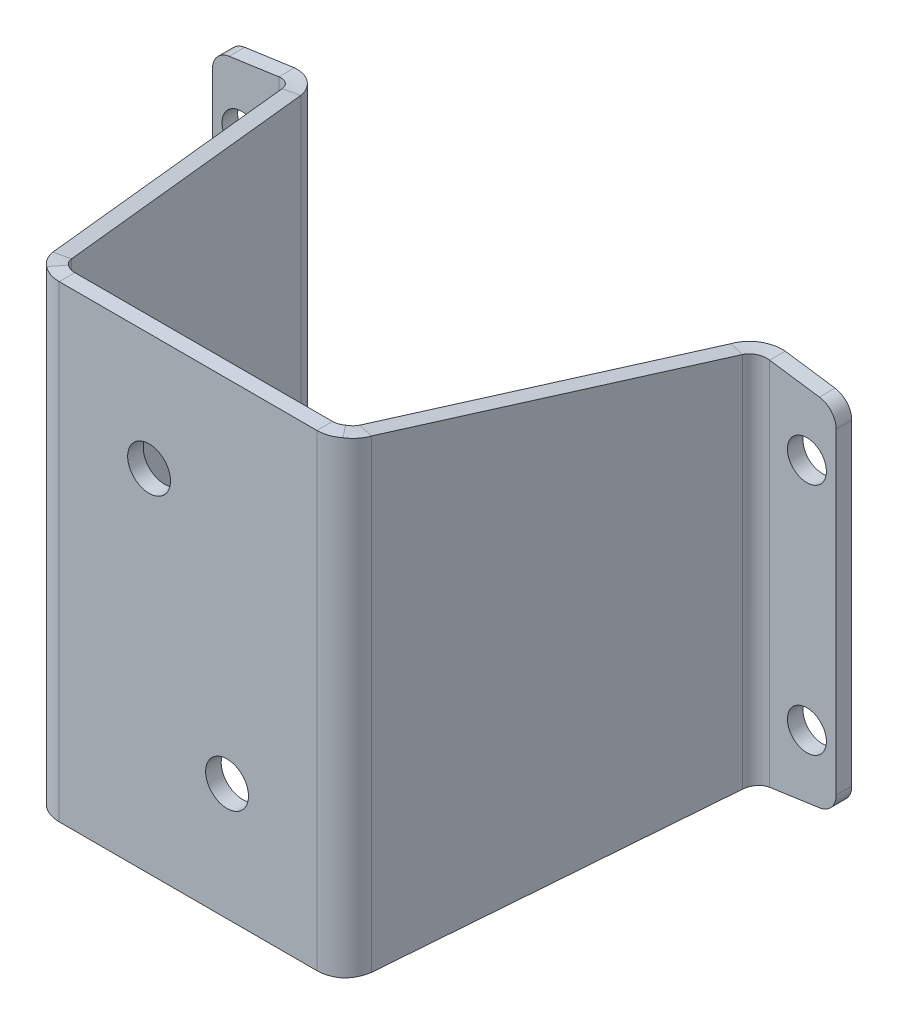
ISO-10303-21;
HEADER;
FILE_DESCRIPTION(('STEP AP214'),'2;1');
FILE_NAME('part.step','',(''),(''),'','','');
FILE_SCHEMA(('AUTOMOTIVE_DESIGN { 1 0 10303 214 1 1 1 1 }'));
ENDSEC;
DATA;
#1=APPLICATION_CONTEXT('core data for automotive mechanical design processes');
#2=APPLICATION_PROTOCOL_DEFINITION('international standard','automotive_design',2000,#1);
#3=PRODUCT_CONTEXT('',#1,'mechanical');
#4=PRODUCT('Part','Part','',(#3));
#5=PRODUCT_RELATED_PRODUCT_CATEGORY('part','',(#4));
#6=PRODUCT_DEFINITION_FORMATION('','',#4);
#7=PRODUCT_DEFINITION_CONTEXT('part definition',#1,'design');
#8=PRODUCT_DEFINITION('design','',#6,#7);
#9=PRODUCT_DEFINITION_SHAPE('','',#8);
#10=(LENGTH_UNIT() NAMED_UNIT(*) SI_UNIT(.MILLI.,.METRE.));
#11=(NAMED_UNIT(*) PLANE_ANGLE_UNIT() SI_UNIT($,.RADIAN.));
#12=(NAMED_UNIT(*) SI_UNIT($,.STERADIAN.) SOLID_ANGLE_UNIT());
#13=UNCERTAINTY_MEASURE_WITH_UNIT(LENGTH_MEASURE(1.E-05),#10,'distance_accuracy_value','');
#14=(GEOMETRIC_REPRESENTATION_CONTEXT(3) GLOBAL_UNCERTAINTY_ASSIGNED_CONTEXT((#13)) GLOBAL_UNIT_ASSIGNED_CONTEXT((#10,
#11,#12)) REPRESENTATION_CONTEXT('',''));
#15=CARTESIAN_POINT('',(0.,0.,0.));
#16=DIRECTION('',(0.,0.,1.));
#17=DIRECTION('',(1.,0.,0.));
#18=AXIS2_PLACEMENT_3D('',#15,#16,#17);
#19=CARTESIAN_POINT('',(74.9872124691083,40.6635229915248,-82.2274502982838));
#20=DIRECTION('',(0.,0.,1.));
#21=DIRECTION('',(1.,0.,0.));
#22=AXIS2_PLACEMENT_3D('',#19,#20,#21);
#23=PLANE('',#22);
#24=CARTESIAN_POINT('',(72.4872124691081,-30.,-82.227450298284));
#25=DIRECTION('',(0.,0.,1.));
#26=DIRECTION('',(0.,-1.,0.));
#27=AXIS2_PLACEMENT_3D('',#24,#25,#26);
#28=CIRCLE('',#27,5.);
#29=CARTESIAN_POINT('',(72.4872124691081,-35.,-82.227450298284));
#30=VERTEX_POINT('',#29);
#31=EDGE_CURVE('E913',#30,#30,#28,.T.);
#32=ORIENTED_EDGE('',*,*,#31,.F.);
#33=EDGE_LOOP('',(#32));
#34=FACE_BOUND('',#33,.T.);
#35=CARTESIAN_POINT('',(72.4872124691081,30.,-82.2274502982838));
#36=DIRECTION('',(0.,0.,1.));
#37=DIRECTION('',(0.,-1.,0.));
#38=AXIS2_PLACEMENT_3D('',#35,#36,#37);
#39=CIRCLE('',#38,5.00000000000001);
#40=CARTESIAN_POINT('',(72.4872124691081,25.,-82.2274502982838));
#41=VERTEX_POINT('',#40);
#42=EDGE_CURVE('E248',#41,#41,#39,.T.);
#43=ORIENTED_EDGE('',*,*,#42,.F.);
#44=EDGE_LOOP('',(#43));
#45=FACE_BOUND('',#44,.T.);
#46=DIRECTION('',(-0.989949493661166,0.141421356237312,0.));
#47=VECTOR('',#46,1.);
#48=CARTESIAN_POINT('',(-25.0127875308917,60.0000000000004,-82.2274502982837));
#49=LINE('',#48,#47);
#50=CARTESIAN_POINT('',(75.6943192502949,45.6132704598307,-82.2274502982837));
#51=VERTEX_POINT('',#50);
#52=CARTESIAN_POINT('',(62.9322810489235,47.4364187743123,-82.2274502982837));
#53=VERTEX_POINT('',#52);
#54=EDGE_CURVE('E1123',#51,#53,#49,.T.);
#55=ORIENTED_EDGE('',*,*,#54,.T.);
#56=DIRECTION('',(0.,-1.,0.));
#57=VECTOR('',#56,1.);
#58=CARTESIAN_POINT('',(62.9322810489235,40.6635229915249,-82.2274502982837));
#59=LINE('',#58,#57);
#60=CARTESIAN_POINT('',(62.9322810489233,-47.4364187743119,-82.227450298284));
#61=VERTEX_POINT('',#60);
#62=EDGE_CURVE('E246',#53,#61,#59,.T.);
#63=ORIENTED_EDGE('',*,*,#62,.T.);
#64=DIRECTION('',(0.989949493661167,0.141421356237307,0.));
#65=VECTOR('',#64,1.);
#66=CARTESIAN_POINT('',(75.6943192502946,-45.6132704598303,-82.227450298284));
#67=LINE('',#66,#65);
#68=CARTESIAN_POINT('',(75.6943192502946,-45.6132704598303,-82.227450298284));
#69=VERTEX_POINT('',#68);
#70=EDGE_CURVE('E1153',#61,#69,#67,.T.);
#71=ORIENTED_EDGE('',*,*,#70,.T.);
#72=CARTESIAN_POINT('',(74.9872124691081,-40.6635229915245,-82.227450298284));
#73=DIRECTION('',(0.,0.,1.));
#74=DIRECTION('',(-1.,0.,0.));
#75=AXIS2_PLACEMENT_3D('',#72,#73,#74);
#76=CIRCLE('',#75,4.99999999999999);
#77=CARTESIAN_POINT('',(79.9872124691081,-40.6635229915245,-82.227450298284));
#78=VERTEX_POINT('',#77);
#79=EDGE_CURVE('E1141',#69,#78,#76,.T.);
#80=ORIENTED_EDGE('',*,*,#79,.T.);
#81=DIRECTION('',(0.,1.,0.));
#82=VECTOR('',#81,1.);
#83=CARTESIAN_POINT('',(79.9872124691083,40.6635229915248,-82.2274502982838));
#84=LINE('',#83,#82);
#85=CARTESIAN_POINT('',(79.9872124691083,40.6635229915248,-82.2274502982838));
#86=VERTEX_POINT('',#85);
#87=EDGE_CURVE('E1137',#78,#86,#84,.T.);
#88=ORIENTED_EDGE('',*,*,#87,.T.);
#89=CARTESIAN_POINT('',(74.9872124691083,40.6635229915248,-82.2274502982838));
#90=DIRECTION('',(0.,0.,1.));
#91=DIRECTION('',(1.,0.,0.));
#92=AXIS2_PLACEMENT_3D('',#89,#90,#91);
#93=CIRCLE('',#92,5.00000000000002);
#94=EDGE_CURVE('E1131',#86,#51,#93,.T.);
#95=ORIENTED_EDGE('',*,*,#94,.T.);
#96=EDGE_LOOP('',(#55,#63,#71,#80,#88,#95));
#97=FACE_BOUND('',#96,.T.);
#98=ADVANCED_FACE('F30',(#34,#45,#97),#23,.T.);
#99=CARTESIAN_POINT('',(74.9872124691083,40.6635229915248,-86.2274502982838));
#100=DIRECTION('',(0.,0.,1.));
#101=DIRECTION('',(1.,0.,0.));
#102=AXIS2_PLACEMENT_3D('',#99,#100,#101);
#103=PLANE('',#102);
#104=CARTESIAN_POINT('',(72.4872124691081,-30.,-86.2274502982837));
#105=DIRECTION('',(0.,0.,-1.));
#106=DIRECTION('',(-1.,0.,0.));
#107=AXIS2_PLACEMENT_3D('',#104,#105,#106);
#108=CIRCLE('',#107,5.);
#109=CARTESIAN_POINT('',(67.4872124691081,-30.,-86.2274502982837));
#110=VERTEX_POINT('',#109);
#111=EDGE_CURVE('E916',#110,#110,#108,.T.);
#112=ORIENTED_EDGE('',*,*,#111,.F.);
#113=EDGE_LOOP('',(#112));
#114=FACE_BOUND('',#113,.T.);
#115=CARTESIAN_POINT('',(72.4872124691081,30.,-86.2274502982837));
#116=DIRECTION('',(0.,0.,-1.));
#117=DIRECTION('',(-1.,0.,0.));
#118=AXIS2_PLACEMENT_3D('',#115,#116,#117);
#119=CIRCLE('',#118,5.00000000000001);
#120=CARTESIAN_POINT('',(67.4872124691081,30.,-86.2274502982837));
#121=VERTEX_POINT('',#120);
#122=EDGE_CURVE('E910',#121,#121,#119,.T.);
#123=ORIENTED_EDGE('',*,*,#122,.F.);
#124=EDGE_LOOP('',(#123));
#125=FACE_BOUND('',#124,.T.);
#126=DIRECTION('',(0.,-1.,0.));
#127=VECTOR('',#126,1.);
#128=CARTESIAN_POINT('',(62.9322810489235,40.6635229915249,-86.2274502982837));
#129=LINE('',#128,#127);
#130=CARTESIAN_POINT('',(62.9322810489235,47.4364187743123,-86.2274502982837));
#131=VERTEX_POINT('',#130);
#132=CARTESIAN_POINT('',(62.9322810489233,-47.4364187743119,-86.2274502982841));
#133=VERTEX_POINT('',#132);
#134=EDGE_CURVE('E54',#131,#133,#129,.T.);
#135=ORIENTED_EDGE('',*,*,#134,.F.);
#136=DIRECTION('',(-0.989949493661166,0.141421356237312,0.));
#137=VECTOR('',#136,1.);
#138=CARTESIAN_POINT('',(-25.0127875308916,60.0000000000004,-86.2274502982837));
#139=LINE('',#138,#137);
#140=CARTESIAN_POINT('',(75.6943192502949,45.6132704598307,-86.2274502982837));
#141=VERTEX_POINT('',#140);
#142=EDGE_CURVE('E1155',#141,#131,#139,.T.);
#143=ORIENTED_EDGE('',*,*,#142,.F.);
#144=CARTESIAN_POINT('',(74.9872124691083,40.6635229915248,-86.2274502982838));
#145=DIRECTION('',(0.,0.,1.));
#146=DIRECTION('',(1.,0.,0.));
#147=AXIS2_PLACEMENT_3D('',#144,#145,#146);
#148=CIRCLE('',#147,5.00000000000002);
#149=CARTESIAN_POINT('',(79.9872124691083,40.6635229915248,-86.2274502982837));
#150=VERTEX_POINT('',#149);
#151=EDGE_CURVE('E1175',#150,#141,#148,.T.);
#152=ORIENTED_EDGE('',*,*,#151,.F.);
#153=DIRECTION('',(0.,1.,0.));
#154=VECTOR('',#153,1.);
#155=CARTESIAN_POINT('',(79.9872124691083,40.6635229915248,-86.2274502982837));
#156=LINE('',#155,#154);
#157=CARTESIAN_POINT('',(79.9872124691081,-40.6635229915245,-86.227450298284));
#158=VERTEX_POINT('',#157);
#159=EDGE_CURVE('E1177',#158,#150,#156,.T.);
#160=ORIENTED_EDGE('',*,*,#159,.F.);
#161=CARTESIAN_POINT('',(74.9872124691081,-40.6635229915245,-86.227450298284));
#162=DIRECTION('',(0.,0.,1.));
#163=DIRECTION('',(-1.,0.,0.));
#164=AXIS2_PLACEMENT_3D('',#161,#162,#163);
#165=CIRCLE('',#164,4.99999999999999);
#166=CARTESIAN_POINT('',(75.6943192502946,-45.6132704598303,-86.227450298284));
#167=VERTEX_POINT('',#166);
#168=EDGE_CURVE('E800',#167,#158,#165,.T.);
#169=ORIENTED_EDGE('',*,*,#168,.F.);
#170=DIRECTION('',(0.989949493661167,0.141421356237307,0.));
#171=VECTOR('',#170,1.);
#172=CARTESIAN_POINT('',(75.6943192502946,-45.6132704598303,-86.227450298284));
#173=LINE('',#172,#171);
#174=EDGE_CURVE('E969',#133,#167,#173,.T.);
#175=ORIENTED_EDGE('',*,*,#174,.F.);
#176=EDGE_LOOP('',(#135,#143,#152,#160,#169,#175));
#177=FACE_BOUND('',#176,.T.);
#178=ADVANCED_FACE('F1105',(#114,#125,#177),#103,.F.);
#179=CARTESIAN_POINT('',(75.6943192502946,-45.6132704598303,-82.227450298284));
#180=DIRECTION('',(-0.141421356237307,0.989949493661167,0.));
#181=DIRECTION('',(-0.989949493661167,-0.141421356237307,0.));
#182=AXIS2_PLACEMENT_3D('',#179,#180,#181);
#183=PLANE('',#182);
#184=CARTESIAN_POINT('',(62.9322810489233,-47.4364187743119,-86.227450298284));
#185=CARTESIAN_POINT('',(62.9322810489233,-47.4364187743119,-82.227450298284));
#186=B_SPLINE_CURVE_WITH_KNOTS('',1,(#184,#185),.UNSPECIFIED.,.F.,.F.,(2,2),(0.,1.),.UNSPECIFIED.);
#187=EDGE_CURVE('E40',#133,#61,#186,.T.);
#188=ORIENTED_EDGE('',*,*,#187,.F.);
#189=ORIENTED_EDGE('',*,*,#174,.T.);
#190=DIRECTION('',(0.,0.,-1.));
#191=VECTOR('',#190,1.);
#192=CARTESIAN_POINT('',(75.6943192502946,-45.6132704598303,-82.227450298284));
#193=LINE('',#192,#191);
#194=EDGE_CURVE('E1150',#69,#167,#193,.T.);
#195=ORIENTED_EDGE('',*,*,#194,.F.);
#196=ORIENTED_EDGE('',*,*,#70,.F.);
#197=EDGE_LOOP('',(#188,#189,#195,#196));
#198=FACE_BOUND('',#197,.T.);
#199=ADVANCED_FACE('F32',(#198),#183,.F.);
#200=CARTESIAN_POINT('',(74.9872124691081,-40.6635229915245,-82.227450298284));
#201=DIRECTION('',(0.,0.,-1.));
#202=DIRECTION('',(-1.,0.,0.));
#203=AXIS2_PLACEMENT_3D('',#200,#201,#202);
#204=CYLINDRICAL_SURFACE('',#203,4.99999999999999);
#205=ORIENTED_EDGE('',*,*,#168,.T.);
#206=DIRECTION('',(0.,0.,-1.));
#207=VECTOR('',#206,1.);
#208=CARTESIAN_POINT('',(79.9872124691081,-40.6635229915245,-82.227450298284));
#209=LINE('',#208,#207);
#210=EDGE_CURVE('E1147',#78,#158,#209,.T.);
#211=ORIENTED_EDGE('',*,*,#210,.F.);
#212=ORIENTED_EDGE('',*,*,#79,.F.);
#213=ORIENTED_EDGE('',*,*,#194,.T.);
#214=EDGE_LOOP('',(#205,#211,#212,#213));
#215=FACE_BOUND('',#214,.T.);
#216=ADVANCED_FACE('F1187',(#215),#204,.T.);
#217=CARTESIAN_POINT('',(79.9872124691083,40.6635229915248,-82.2274502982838));
#218=DIRECTION('',(-1.,0.,0.));
#219=DIRECTION('',(0.,-1.,0.));
#220=AXIS2_PLACEMENT_3D('',#217,#218,#219);
#221=PLANE('',#220);
#222=ORIENTED_EDGE('',*,*,#159,.T.);
#223=DIRECTION('',(0.,0.,-1.));
#224=VECTOR('',#223,1.);
#225=CARTESIAN_POINT('',(79.9872124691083,40.6635229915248,-82.2274502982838));
#226=LINE('',#225,#224);
#227=EDGE_CURVE('E1135',#86,#150,#226,.T.);
#228=ORIENTED_EDGE('',*,*,#227,.F.);
#229=ORIENTED_EDGE('',*,*,#87,.F.);
#230=ORIENTED_EDGE('',*,*,#210,.T.);
#231=EDGE_LOOP('',(#222,#228,#229,#230));
#232=FACE_BOUND('',#231,.T.);
#233=ADVANCED_FACE('F1191',(#232),#221,.F.);
#234=CARTESIAN_POINT('',(74.9872124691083,40.6635229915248,-82.2274502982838));
#235=DIRECTION('',(0.,0.,-1.));
#236=DIRECTION('',(-1.,0.,0.));
#237=AXIS2_PLACEMENT_3D('',#234,#235,#236);
#238=CYLINDRICAL_SURFACE('',#237,5.00000000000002);
#239=ORIENTED_EDGE('',*,*,#151,.T.);
#240=DIRECTION('',(0.,0.,-1.));
#241=VECTOR('',#240,1.);
#242=CARTESIAN_POINT('',(75.6943192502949,45.6132704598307,-82.2274502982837));
#243=LINE('',#242,#241);
#244=EDGE_CURVE('E1130',#51,#141,#243,.T.);
#245=ORIENTED_EDGE('',*,*,#244,.F.);
#246=ORIENTED_EDGE('',*,*,#94,.F.);
#247=ORIENTED_EDGE('',*,*,#227,.T.);
#248=EDGE_LOOP('',(#239,#245,#246,#247));
#249=FACE_BOUND('',#248,.T.);
#250=ADVANCED_FACE('F1115',(#249),#238,.T.);
#251=CARTESIAN_POINT('',(-25.0127875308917,60.0000000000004,-82.2274502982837));
#252=DIRECTION('',(-0.141421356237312,-0.989949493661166,0.));
#253=DIRECTION('',(0.989949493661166,-0.141421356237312,0.));
#254=AXIS2_PLACEMENT_3D('',#251,#252,#253);
#255=PLANE('',#254);
#256=CARTESIAN_POINT('',(62.9322810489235,47.4364187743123,-82.2274502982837));
#257=CARTESIAN_POINT('',(62.9322810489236,47.4364187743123,-86.2274502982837));
#258=B_SPLINE_CURVE_WITH_KNOTS('',1,(#256,#257),.UNSPECIFIED.,.F.,.F.,(2,2),(0.,1.),.UNSPECIFIED.);
#259=EDGE_CURVE('E11',#53,#131,#258,.T.);
#260=ORIENTED_EDGE('',*,*,#259,.F.);
#261=ORIENTED_EDGE('',*,*,#54,.F.);
#262=ORIENTED_EDGE('',*,*,#244,.T.);
#263=ORIENTED_EDGE('',*,*,#142,.T.);
#264=EDGE_LOOP('',(#260,#261,#262,#263));
#265=FACE_BOUND('',#264,.T.);
#266=ADVANCED_FACE('F822',(#265),#255,.F.);
#267=CARTESIAN_POINT('',(197.012787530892,40.6635229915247,-82.2274502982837));
#268=DIRECTION('',(0.,0.,1.));
#269=DIRECTION('',(1.,0.,0.));
#270=AXIS2_PLACEMENT_3D('',#267,#268,#269);
#271=PLANE('',#270);
#272=CARTESIAN_POINT('',(-72.5127875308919,30.,-82.2274502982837));
#273=DIRECTION('',(0.,0.,1.));
#274=DIRECTION('',(1.,0.,0.));
#275=AXIS2_PLACEMENT_3D('',#272,#273,#274);
#276=CIRCLE('',#275,5.00000000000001);
#277=CARTESIAN_POINT('',(-67.5127875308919,30.,-82.2274502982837));
#278=VERTEX_POINT('',#277);
#279=EDGE_CURVE('E925',#278,#278,#276,.T.);
#280=ORIENTED_EDGE('',*,*,#279,.F.);
#281=EDGE_LOOP('',(#280));
#282=FACE_BOUND('',#281,.T.);
#283=CARTESIAN_POINT('',(-72.5127875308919,-30.,-82.2274502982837));
#284=DIRECTION('',(0.,0.,1.));
#285=DIRECTION('',(1.,0.,0.));
#286=AXIS2_PLACEMENT_3D('',#283,#284,#285);
#287=CIRCLE('',#286,5.);
#288=CARTESIAN_POINT('',(-67.5127875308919,-30.,-82.2274502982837));
#289=VERTEX_POINT('',#288);
#290=EDGE_CURVE('E919',#289,#289,#287,.T.);
#291=ORIENTED_EDGE('',*,*,#290,.F.);
#292=EDGE_LOOP('',(#291));
#293=FACE_BOUND('',#292,.T.);
#294=DIRECTION('',(0.989949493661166,-0.14142135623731,0.));
#295=VECTOR('',#294,1.);
#296=CARTESIAN_POINT('',(25.0127875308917,-60.,-82.2274502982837));
#297=LINE('',#296,#295);
#298=CARTESIAN_POINT('',(-75.6943192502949,-45.6132704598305,-82.2274502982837));
#299=VERTEX_POINT('',#298);
#300=CARTESIAN_POINT('',(-62.9322810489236,-47.4364187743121,-82.2274502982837));
#301=VERTEX_POINT('',#300);
#302=EDGE_CURVE('E837',#299,#301,#297,.T.);
#303=ORIENTED_EDGE('',*,*,#302,.T.);
#304=DIRECTION('',(0.,1.,0.));
#305=VECTOR('',#304,1.);
#306=CARTESIAN_POINT('',(-62.9322810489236,40.6635229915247,-82.2274502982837));
#307=LINE('',#306,#305);
#308=CARTESIAN_POINT('',(-62.9322810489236,47.4364187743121,-82.2274502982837));
#309=VERTEX_POINT('',#308);
#310=EDGE_CURVE('E949',#301,#309,#307,.T.);
#311=ORIENTED_EDGE('',*,*,#310,.T.);
#312=DIRECTION('',(-0.989949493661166,-0.14142135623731,0.));
#313=VECTOR('',#312,1.);
#314=CARTESIAN_POINT('',(-75.6943192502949,45.6132704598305,-82.2274502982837));
#315=LINE('',#314,#313);
#316=CARTESIAN_POINT('',(-75.6943192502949,45.6132704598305,-82.2274502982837));
#317=VERTEX_POINT('',#316);
#318=EDGE_CURVE('E956',#309,#317,#315,.T.);
#319=ORIENTED_EDGE('',*,*,#318,.T.);
#320=CARTESIAN_POINT('',(-74.9872124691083,40.6635229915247,-82.2274502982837));
#321=DIRECTION('',(0.,0.,1.));
#322=DIRECTION('',(-1.,0.,0.));
#323=AXIS2_PLACEMENT_3D('',#320,#321,#322);
#324=CIRCLE('',#323,5.00000000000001);
#325=CARTESIAN_POINT('',(-79.9872124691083,40.6635229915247,-82.2274502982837));
#326=VERTEX_POINT('',#325);
#327=EDGE_CURVE('E1292',#317,#326,#324,.T.);
#328=ORIENTED_EDGE('',*,*,#327,.T.);
#329=DIRECTION('',(0.,-1.,0.));
#330=VECTOR('',#329,1.);
#331=CARTESIAN_POINT('',(-79.9872124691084,-40.6635229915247,-82.2274502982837));
#332=LINE('',#331,#330);
#333=CARTESIAN_POINT('',(-79.9872124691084,-40.6635229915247,-82.2274502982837));
#334=VERTEX_POINT('',#333);
#335=EDGE_CURVE('E1294',#326,#334,#332,.T.);
#336=ORIENTED_EDGE('',*,*,#335,.T.);
#337=CARTESIAN_POINT('',(-74.9872124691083,-40.6635229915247,-82.2274502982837));
#338=DIRECTION('',(0.,0.,1.));
#339=DIRECTION('',(-1.,0.,0.));
#340=AXIS2_PLACEMENT_3D('',#337,#338,#339);
#341=CIRCLE('',#340,5.00000000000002);
#342=EDGE_CURVE('E846',#334,#299,#341,.T.);
#343=ORIENTED_EDGE('',*,*,#342,.T.);
#344=EDGE_LOOP('',(#303,#311,#319,#328,#336,#343));
#345=FACE_BOUND('',#344,.T.);
#346=ADVANCED_FACE('F818',(#282,#293,#345),#271,.T.);
#347=CARTESIAN_POINT('',(197.012787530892,40.6635229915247,-86.2274502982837));
#348=DIRECTION('',(0.,0.,1.));
#349=DIRECTION('',(1.,0.,0.));
#350=AXIS2_PLACEMENT_3D('',#347,#348,#349);
#351=PLANE('',#350);
#352=CARTESIAN_POINT('',(-72.5127875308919,30.,-86.2274502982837));
#353=DIRECTION('',(0.,0.,-1.));
#354=DIRECTION('',(-1.,0.,0.));
#355=AXIS2_PLACEMENT_3D('',#352,#353,#354);
#356=CIRCLE('',#355,5.00000000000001);
#357=CARTESIAN_POINT('',(-77.5127875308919,30.,-86.2274502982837));
#358=VERTEX_POINT('',#357);
#359=EDGE_CURVE('E928',#358,#358,#356,.T.);
#360=ORIENTED_EDGE('',*,*,#359,.F.);
#361=EDGE_LOOP('',(#360));
#362=FACE_BOUND('',#361,.T.);
#363=CARTESIAN_POINT('',(-72.5127875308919,-30.,-86.2274502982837));
#364=DIRECTION('',(0.,0.,-1.));
#365=DIRECTION('',(-1.,0.,0.));
#366=AXIS2_PLACEMENT_3D('',#363,#364,#365);
#367=CIRCLE('',#366,5.);
#368=CARTESIAN_POINT('',(-77.5127875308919,-30.,-86.2274502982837));
#369=VERTEX_POINT('',#368);
#370=EDGE_CURVE('E922',#369,#369,#367,.T.);
#371=ORIENTED_EDGE('',*,*,#370,.F.);
#372=EDGE_LOOP('',(#371));
#373=FACE_BOUND('',#372,.T.);
#374=DIRECTION('',(0.,1.,0.));
#375=VECTOR('',#374,1.);
#376=CARTESIAN_POINT('',(-62.9322810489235,40.6635229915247,-86.2274502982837));
#377=LINE('',#376,#375);
#378=CARTESIAN_POINT('',(-62.9322810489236,-47.4364187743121,-86.2274502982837));
#379=VERTEX_POINT('',#378);
#380=CARTESIAN_POINT('',(-62.9322810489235,47.4364187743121,-86.2274502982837));
#381=VERTEX_POINT('',#380);
#382=EDGE_CURVE('E939',#379,#381,#377,.T.);
#383=ORIENTED_EDGE('',*,*,#382,.F.);
#384=DIRECTION('',(0.989949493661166,-0.14142135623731,0.));
#385=VECTOR('',#384,1.);
#386=CARTESIAN_POINT('',(25.0127875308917,-60.,-86.2274502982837));
#387=LINE('',#386,#385);
#388=CARTESIAN_POINT('',(-75.6943192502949,-45.6132704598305,-86.2274502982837));
#389=VERTEX_POINT('',#388);
#390=EDGE_CURVE('E942',#389,#379,#387,.T.);
#391=ORIENTED_EDGE('',*,*,#390,.F.);
#392=CARTESIAN_POINT('',(-74.9872124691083,-40.6635229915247,-86.2274502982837));
#393=DIRECTION('',(0.,0.,1.));
#394=DIRECTION('',(-1.,0.,0.));
#395=AXIS2_PLACEMENT_3D('',#392,#393,#394);
#396=CIRCLE('',#395,5.00000000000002);
#397=CARTESIAN_POINT('',(-79.9872124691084,-40.6635229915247,-86.2274502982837));
#398=VERTEX_POINT('',#397);
#399=EDGE_CURVE('E957',#398,#389,#396,.T.);
#400=ORIENTED_EDGE('',*,*,#399,.F.);
#401=DIRECTION('',(0.,-1.,0.));
#402=VECTOR('',#401,1.);
#403=CARTESIAN_POINT('',(-79.9872124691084,-40.6635229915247,-86.2274502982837));
#404=LINE('',#403,#402);
#405=CARTESIAN_POINT('',(-79.9872124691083,40.6635229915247,-86.2274502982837));
#406=VERTEX_POINT('',#405);
#407=EDGE_CURVE('E1289',#406,#398,#404,.T.);
#408=ORIENTED_EDGE('',*,*,#407,.F.);
#409=CARTESIAN_POINT('',(-74.9872124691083,40.6635229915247,-86.2274502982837));
#410=DIRECTION('',(0.,0.,1.));
#411=DIRECTION('',(-1.,0.,0.));
#412=AXIS2_PLACEMENT_3D('',#409,#410,#411);
#413=CIRCLE('',#412,5.00000000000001);
#414=CARTESIAN_POINT('',(-75.6943192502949,45.6132704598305,-86.2274502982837));
#415=VERTEX_POINT('',#414);
#416=EDGE_CURVE('E1282',#415,#406,#413,.T.);
#417=ORIENTED_EDGE('',*,*,#416,.F.);
#418=DIRECTION('',(-0.989949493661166,-0.14142135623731,0.));
#419=VECTOR('',#418,1.);
#420=CARTESIAN_POINT('',(-75.6943192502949,45.6132704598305,-86.2274502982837));
#421=LINE('',#420,#419);
#422=EDGE_CURVE('E258',#381,#415,#421,.T.);
#423=ORIENTED_EDGE('',*,*,#422,.F.);
#424=EDGE_LOOP('',(#383,#391,#400,#408,#417,#423));
#425=FACE_BOUND('',#424,.T.);
#426=ADVANCED_FACE('F813',(#362,#373,#425),#351,.F.);
#427=CARTESIAN_POINT('',(-75.6943192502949,45.6132704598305,-82.2274502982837));
#428=DIRECTION('',(0.14142135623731,-0.989949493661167,0.));
#429=DIRECTION('',(0.989949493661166,0.14142135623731,0.));
#430=AXIS2_PLACEMENT_3D('',#427,#428,#429);
#431=PLANE('',#430);
#432=CARTESIAN_POINT('',(-62.9322810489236,47.4364187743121,-86.2274502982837));
#433=CARTESIAN_POINT('',(-62.9322810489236,47.4364187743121,-82.2274502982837));
#434=B_SPLINE_CURVE_WITH_KNOTS('',1,(#432,#433),.UNSPECIFIED.,.F.,.F.,(2,2),(0.,1.),.UNSPECIFIED.);
#435=EDGE_CURVE('E948',#381,#309,#434,.T.);
#436=ORIENTED_EDGE('',*,*,#435,.F.);
#437=ORIENTED_EDGE('',*,*,#422,.T.);
#438=DIRECTION('',(0.,0.,-1.));
#439=VECTOR('',#438,1.);
#440=CARTESIAN_POINT('',(-75.6943192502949,45.6132704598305,-82.2274502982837));
#441=LINE('',#440,#439);
#442=EDGE_CURVE('E1304',#317,#415,#441,.T.);
#443=ORIENTED_EDGE('',*,*,#442,.F.);
#444=ORIENTED_EDGE('',*,*,#318,.F.);
#445=EDGE_LOOP('',(#436,#437,#443,#444));
#446=FACE_BOUND('',#445,.T.);
#447=ADVANCED_FACE('F817',(#446),#431,.F.);
#448=CARTESIAN_POINT('',(-74.9872124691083,40.6635229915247,-82.2274502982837));
#449=DIRECTION('',(0.,0.,-1.));
#450=DIRECTION('',(-1.,0.,0.));
#451=AXIS2_PLACEMENT_3D('',#448,#449,#450);
#452=CYLINDRICAL_SURFACE('',#451,5.00000000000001);
#453=ORIENTED_EDGE('',*,*,#416,.T.);
#454=DIRECTION('',(0.,0.,-1.));
#455=VECTOR('',#454,1.);
#456=CARTESIAN_POINT('',(-79.9872124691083,40.6635229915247,-82.2274502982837));
#457=LINE('',#456,#455);
#458=EDGE_CURVE('E1301',#326,#406,#457,.T.);
#459=ORIENTED_EDGE('',*,*,#458,.F.);
#460=ORIENTED_EDGE('',*,*,#327,.F.);
#461=ORIENTED_EDGE('',*,*,#442,.T.);
#462=EDGE_LOOP('',(#453,#459,#460,#461));
#463=FACE_BOUND('',#462,.T.);
#464=ADVANCED_FACE('F1104',(#463),#452,.T.);
#465=CARTESIAN_POINT('',(-79.9872124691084,-40.6635229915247,-82.2274502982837));
#466=DIRECTION('',(1.,0.,0.));
#467=DIRECTION('',(0.,0.,-1.));
#468=AXIS2_PLACEMENT_3D('',#465,#466,#467);
#469=PLANE('',#468);
#470=ORIENTED_EDGE('',*,*,#407,.T.);
#471=DIRECTION('',(0.,0.,-1.));
#472=VECTOR('',#471,1.);
#473=CARTESIAN_POINT('',(-79.9872124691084,-40.6635229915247,-82.2274502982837));
#474=LINE('',#473,#472);
#475=EDGE_CURVE('E1298',#334,#398,#474,.T.);
#476=ORIENTED_EDGE('',*,*,#475,.F.);
#477=ORIENTED_EDGE('',*,*,#335,.F.);
#478=ORIENTED_EDGE('',*,*,#458,.T.);
#479=EDGE_LOOP('',(#470,#476,#477,#478));
#480=FACE_BOUND('',#479,.T.);
#481=ADVANCED_FACE('F1315',(#480),#469,.F.);
#482=CARTESIAN_POINT('',(-74.9872124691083,-40.6635229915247,-82.2274502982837));
#483=DIRECTION('',(0.,0.,-1.));
#484=DIRECTION('',(-1.,0.,0.));
#485=AXIS2_PLACEMENT_3D('',#482,#483,#484);
#486=CYLINDRICAL_SURFACE('',#485,5.00000000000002);
#487=ORIENTED_EDGE('',*,*,#399,.T.);
#488=DIRECTION('',(0.,0.,-1.));
#489=VECTOR('',#488,1.);
#490=CARTESIAN_POINT('',(-75.6943192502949,-45.6132704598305,-82.2274502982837));
#491=LINE('',#490,#489);
#492=EDGE_CURVE('E845',#299,#389,#491,.T.);
#493=ORIENTED_EDGE('',*,*,#492,.F.);
#494=ORIENTED_EDGE('',*,*,#342,.F.);
#495=ORIENTED_EDGE('',*,*,#475,.T.);
#496=EDGE_LOOP('',(#487,#493,#494,#495));
#497=FACE_BOUND('',#496,.T.);
#498=ADVANCED_FACE('F828',(#497),#486,.T.);
#499=CARTESIAN_POINT('',(25.0127875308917,-60.,-82.2274502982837));
#500=DIRECTION('',(0.14142135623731,0.989949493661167,0.));
#501=DIRECTION('',(-0.989949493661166,0.14142135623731,0.));
#502=AXIS2_PLACEMENT_3D('',#499,#500,#501);
#503=PLANE('',#502);
#504=CARTESIAN_POINT('',(-62.9322810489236,-47.4364187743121,-82.2274502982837));
#505=CARTESIAN_POINT('',(-62.9322810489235,-47.4364187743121,-86.2274502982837));
#506=B_SPLINE_CURVE_WITH_KNOTS('',1,(#504,#505),.UNSPECIFIED.,.F.,.F.,(2,2),(0.,1.),.UNSPECIFIED.);
#507=EDGE_CURVE('E954',#301,#379,#506,.T.);
#508=ORIENTED_EDGE('',*,*,#507,.F.);
#509=ORIENTED_EDGE('',*,*,#302,.F.);
#510=ORIENTED_EDGE('',*,*,#492,.T.);
#511=ORIENTED_EDGE('',*,*,#390,.T.);
#512=EDGE_LOOP('',(#508,#509,#510,#511));
#513=FACE_BOUND('',#512,.T.);
#514=ADVANCED_FACE('F824',(#513),#503,.F.);
#515=CARTESIAN_POINT('',(59.2751083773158,40.6635229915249,-97.5316098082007));
#516=DIRECTION('',(0.973178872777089,0.,0.230049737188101));
#517=DIRECTION('',(0.230049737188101,0.,-0.973178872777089));
#518=AXIS2_PLACEMENT_3D('',#515,#516,#517);
#519=PLANE('',#518);
#520=DIRECTION('',(-0.227737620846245,0.141421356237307,0.963397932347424));
#521=VECTOR('',#520,1.);
#522=CARTESIAN_POINT('',(36.2701346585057,60.,-0.213722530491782));
#523=LINE('',#522,#521);
#524=CARTESIAN_POINT('',(55.1468500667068,48.2778669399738,-80.0678481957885));
#525=VERTEX_POINT('',#524);
#526=CARTESIAN_POINT('',(36.9476469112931,59.5792759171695,-3.0798010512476));
#527=VERTEX_POINT('',#526);
#528=EDGE_CURVE('E270',#525,#527,#523,.T.);
#529=ORIENTED_EDGE('',*,*,#528,.F.);
#530=DIRECTION('',(0.,-1.,0.));
#531=VECTOR('',#530,1.);
#532=CARTESIAN_POINT('',(55.1468500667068,40.6635229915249,-80.0678481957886));
#533=LINE('',#532,#531);
#534=CARTESIAN_POINT('',(55.1468500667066,-48.2778669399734,-80.0678481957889));
#535=VERTEX_POINT('',#534);
#536=EDGE_CURVE('E259',#525,#535,#533,.T.);
#537=ORIENTED_EDGE('',*,*,#536,.T.);
#538=DIRECTION('',(0.227737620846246,0.141421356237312,-0.963397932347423));
#539=VECTOR('',#538,1.);
#540=CARTESIAN_POINT('',(59.4377781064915,-45.6132704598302,-98.2197511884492));
#541=LINE('',#540,#539);
#542=CARTESIAN_POINT('',(36.9476469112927,-59.5792759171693,-3.07980105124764));
#543=VERTEX_POINT('',#542);
#544=EDGE_CURVE('E286',#543,#535,#541,.T.);
#545=ORIENTED_EDGE('',*,*,#544,.F.);
#546=DIRECTION('',(0.,-1.,0.));
#547=VECTOR('',#546,1.);
#548=CARTESIAN_POINT('',(36.9476469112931,40.663522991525,-3.0798010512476));
#549=LINE('',#548,#547);
#550=EDGE_CURVE('E265',#527,#543,#549,.T.);
#551=ORIENTED_EDGE('',*,*,#550,.F.);
#552=EDGE_LOOP('',(#529,#537,#545,#551));
#553=FACE_BOUND('',#552,.T.);
#554=ADVANCED_FACE('F810',(#553),#519,.F.);
#555=CARTESIAN_POINT('',(63.3304935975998,-45.6132704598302,-97.2995522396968));
#556=DIRECTION('',(-0.0325339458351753,0.989949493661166,0.137628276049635));
#557=DIRECTION('',(-0.227737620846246,-0.141421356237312,0.963397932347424));
#558=AXIS2_PLACEMENT_3D('',#555,#556,#557);
#559=PLANE('',#558);
#560=ORIENTED_EDGE('',*,*,#544,.T.);
#561=CARTESIAN_POINT('',(59.039565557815,-48.2778669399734,-79.1476492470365));
#562=CARTESIAN_POINT('',(55.1468500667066,-48.2778669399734,-80.0678481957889));
#563=B_SPLINE_CURVE_WITH_KNOTS('',1,(#561,#562),.UNSPECIFIED.,.F.,.F.,(2,2),(0.,1.),.UNSPECIFIED.);
#564=CARTESIAN_POINT('',(59.039565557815,-48.2778669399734,-79.1476492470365));
#565=VERTEX_POINT('',#564);
#566=EDGE_CURVE('E234',#535,#565,#563,.F.);
#567=ORIENTED_EDGE('',*,*,#566,.T.);
#568=DIRECTION('',(0.227737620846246,0.141421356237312,-0.963397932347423));
#569=VECTOR('',#568,1.);
#570=CARTESIAN_POINT('',(63.3304935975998,-45.6132704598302,-97.2995522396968));
#571=LINE('',#570,#569);
#572=CARTESIAN_POINT('',(40.8403624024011,-59.5792759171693,-2.15960210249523));
#573=VERTEX_POINT('',#572);
#574=EDGE_CURVE('E257',#573,#565,#571,.T.);
#575=ORIENTED_EDGE('',*,*,#574,.F.);
#576=CARTESIAN_POINT('',(36.9476469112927,-59.5792759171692,-3.07980105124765));
#577=CARTESIAN_POINT('',(40.8403624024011,-59.5792759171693,-2.1596021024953));
#578=B_SPLINE_CURVE_WITH_KNOTS('',1,(#576,#577),.UNSPECIFIED.,.F.,.F.,(2,2),(0.,1.),.UNSPECIFIED.);
#579=EDGE_CURVE('E751',#543,#573,#578,.T.);
#580=ORIENTED_EDGE('',*,*,#579,.F.);
#581=EDGE_LOOP('',(#560,#567,#575,#580));
#582=FACE_BOUND('',#581,.T.);
#583=ADVANCED_FACE('F787',(#582),#559,.F.);
#584=CARTESIAN_POINT('',(40.162850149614,60.,0.706476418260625));
#585=DIRECTION('',(-0.0325339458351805,-0.989949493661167,0.137628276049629));
#586=DIRECTION('',(0.227737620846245,-0.141421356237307,-0.963397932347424));
#587=AXIS2_PLACEMENT_3D('',#584,#585,#586);
#588=PLANE('',#587);
#589=DIRECTION('',(-0.227737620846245,0.141421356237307,0.963397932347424));
#590=VECTOR('',#589,1.);
#591=CARTESIAN_POINT('',(40.162850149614,60.,0.706476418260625));
#592=LINE('',#591,#590);
#593=CARTESIAN_POINT('',(59.0395655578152,48.2778669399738,-79.1476492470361));
#594=VERTEX_POINT('',#593);
#595=CARTESIAN_POINT('',(40.8403624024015,59.5792759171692,-2.15960210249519));
#596=VERTEX_POINT('',#595);
#597=EDGE_CURVE('E254',#594,#596,#592,.T.);
#598=ORIENTED_EDGE('',*,*,#597,.F.);
#599=CARTESIAN_POINT('',(55.1468500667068,48.2778669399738,-80.0678481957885));
#600=CARTESIAN_POINT('',(59.0395655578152,48.2778669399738,-79.1476492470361));
#601=B_SPLINE_CURVE_WITH_KNOTS('',1,(#599,#600),.UNSPECIFIED.,.F.,.F.,(2,2),(0.,1.),.UNSPECIFIED.);
#602=EDGE_CURVE('E218',#594,#525,#601,.F.);
#603=ORIENTED_EDGE('',*,*,#602,.T.);
#604=ORIENTED_EDGE('',*,*,#528,.T.);
#605=CARTESIAN_POINT('',(40.8403624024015,59.5792759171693,-2.1596021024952));
#606=CARTESIAN_POINT('',(36.9476469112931,59.5792759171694,-3.0798010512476));
#607=B_SPLINE_CURVE_WITH_KNOTS('',1,(#605,#606),.UNSPECIFIED.,.F.,.F.,(2,2),(0.,1.),.UNSPECIFIED.);
#608=EDGE_CURVE('E235',#596,#527,#607,.T.);
#609=ORIENTED_EDGE('',*,*,#608,.F.);
#610=EDGE_LOOP('',(#598,#603,#604,#609));
#611=FACE_BOUND('',#610,.T.);
#612=ADVANCED_FACE('F261',(#611),#588,.F.);
#613=CARTESIAN_POINT('',(63.1678238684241,40.6635229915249,-96.6114108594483));
#614=DIRECTION('',(0.973178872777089,0.,0.230049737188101));
#615=DIRECTION('',(0.230049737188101,0.,-0.973178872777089));
#616=AXIS2_PLACEMENT_3D('',#613,#614,#615);
#617=PLANE('',#616);
#618=DIRECTION('',(0.,-1.,0.));
#619=VECTOR('',#618,1.);
#620=CARTESIAN_POINT('',(59.0395655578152,40.6635229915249,-79.1476492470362));
#621=LINE('',#620,#619);
#622=EDGE_CURVE('E243',#594,#565,#621,.T.);
#623=ORIENTED_EDGE('',*,*,#622,.F.);
#624=ORIENTED_EDGE('',*,*,#597,.T.);
#625=DIRECTION('',(0.,-1.,0.));
#626=VECTOR('',#625,1.);
#627=CARTESIAN_POINT('',(40.8403624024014,40.663522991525,-2.1596021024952));
#628=LINE('',#627,#626);
#629=EDGE_CURVE('E268',#596,#573,#628,.T.);
#630=ORIENTED_EDGE('',*,*,#629,.T.);
#631=ORIENTED_EDGE('',*,*,#574,.T.);
#632=EDGE_LOOP('',(#623,#624,#630,#631));
#633=FACE_BOUND('',#632,.T.);
#634=ADVANCED_FACE('F253',(#633),#617,.T.);
#635=CARTESIAN_POINT('',(3.29842013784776,40.6635229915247,167.173043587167));
#636=DIRECTION('',(-0.973178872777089,0.,0.230049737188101));
#637=DIRECTION('',(0.230049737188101,0.,0.973178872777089));
#638=AXIS2_PLACEMENT_3D('',#635,#636,#637);
#639=PLANE('',#638);
#640=DIRECTION('',(0.227737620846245,-0.14142135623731,0.963397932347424));
#641=VECTOR('',#640,1.);
#642=CARTESIAN_POINT('',(-36.2701346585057,-60.,-0.213722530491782));
#643=LINE('',#642,#641);
#644=CARTESIAN_POINT('',(-55.1468500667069,-48.2778669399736,-80.0678481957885));
#645=VERTEX_POINT('',#644);
#646=CARTESIAN_POINT('',(-36.9476469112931,-59.5792759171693,-3.07980105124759));
#647=VERTEX_POINT('',#646);
#648=EDGE_CURVE('E364',#645,#647,#643,.T.);
#649=ORIENTED_EDGE('',*,*,#648,.F.);
#650=DIRECTION('',(0.,1.,0.));
#651=VECTOR('',#650,1.);
#652=CARTESIAN_POINT('',(-55.1468500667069,40.6635229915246,-80.0678481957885));
#653=LINE('',#652,#651);
#654=CARTESIAN_POINT('',(-55.1468500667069,48.2778669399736,-80.0678481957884));
#655=VERTEX_POINT('',#654);
#656=EDGE_CURVE('E303',#645,#655,#653,.T.);
#657=ORIENTED_EDGE('',*,*,#656,.T.);
#658=DIRECTION('',(-0.227737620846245,-0.14142135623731,-0.963397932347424));
#659=VECTOR('',#658,1.);
#660=CARTESIAN_POINT('',(-59.4377781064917,45.6132704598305,-98.2197511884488));
#661=LINE('',#660,#659);
#662=CARTESIAN_POINT('',(-36.9476469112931,59.5792759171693,-3.07980105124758));
#663=VERTEX_POINT('',#662);
#664=EDGE_CURVE('E291',#663,#655,#661,.T.);
#665=ORIENTED_EDGE('',*,*,#664,.F.);
#666=DIRECTION('',(0.,1.,0.));
#667=VECTOR('',#666,1.);
#668=CARTESIAN_POINT('',(-36.9476469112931,40.6635229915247,-3.07980105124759));
#669=LINE('',#668,#667);
#670=EDGE_CURVE('E352',#647,#663,#669,.T.);
#671=ORIENTED_EDGE('',*,*,#670,.F.);
#672=EDGE_LOOP('',(#649,#657,#665,#671));
#673=FACE_BOUND('',#672,.T.);
#674=ADVANCED_FACE('F1352',(#673),#639,.F.);
#675=CARTESIAN_POINT('',(-63.3304935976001,45.6132704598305,-97.2995522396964));
#676=DIRECTION('',(0.032533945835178,-0.989949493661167,0.137628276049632));
#677=DIRECTION('',(0.227737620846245,0.14142135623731,0.963397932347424));
#678=AXIS2_PLACEMENT_3D('',#675,#676,#677);
#679=PLANE('',#678);
#680=ORIENTED_EDGE('',*,*,#664,.T.);
#681=CARTESIAN_POINT('',(-59.0395655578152,48.2778669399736,-79.1476492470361));
#682=CARTESIAN_POINT('',(-55.1468500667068,48.2778669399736,-80.0678481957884));
#683=B_SPLINE_CURVE_WITH_KNOTS('',1,(#681,#682),.UNSPECIFIED.,.F.,.F.,(2,2),(0.,1.),.UNSPECIFIED.);
#684=CARTESIAN_POINT('',(-59.0395655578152,48.2778669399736,-79.1476492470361));
#685=VERTEX_POINT('',#684);
#686=EDGE_CURVE('E306',#655,#685,#683,.F.);
#687=ORIENTED_EDGE('',*,*,#686,.T.);
#688=DIRECTION('',(-0.227737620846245,-0.14142135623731,-0.963397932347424));
#689=VECTOR('',#688,1.);
#690=CARTESIAN_POINT('',(-63.3304935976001,45.6132704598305,-97.2995522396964));
#691=LINE('',#690,#689);
#692=CARTESIAN_POINT('',(-40.8403624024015,59.5792759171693,-2.15960210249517));
#693=VERTEX_POINT('',#692);
#694=EDGE_CURVE('E353',#693,#685,#691,.T.);
#695=ORIENTED_EDGE('',*,*,#694,.F.);
#696=CARTESIAN_POINT('',(-36.9476469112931,59.5792759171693,-3.07980105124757));
#697=CARTESIAN_POINT('',(-40.8403624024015,59.5792759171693,-2.15960210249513));
#698=B_SPLINE_CURVE_WITH_KNOTS('',1,(#696,#697),.UNSPECIFIED.,.F.,.F.,(2,2),(0.,1.),.UNSPECIFIED.);
#699=EDGE_CURVE('E492',#663,#693,#698,.T.);
#700=ORIENTED_EDGE('',*,*,#699,.F.);
#701=EDGE_LOOP('',(#680,#687,#695,#700));
#702=FACE_BOUND('',#701,.T.);
#703=ADVANCED_FACE('F332',(#702),#679,.F.);
#704=CARTESIAN_POINT('',(-40.162850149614,-60.,0.706476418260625));
#705=DIRECTION('',(0.0325339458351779,0.989949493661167,0.137628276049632));
#706=DIRECTION('',(-0.227737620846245,0.14142135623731,-0.963397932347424));
#707=AXIS2_PLACEMENT_3D('',#704,#705,#706);
#708=PLANE('',#707);
#709=DIRECTION('',(0.227737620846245,-0.14142135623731,0.963397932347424));
#710=VECTOR('',#709,1.);
#711=CARTESIAN_POINT('',(-40.162850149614,-60.,0.706476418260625));
#712=LINE('',#711,#710);
#713=CARTESIAN_POINT('',(-59.0395655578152,-48.2778669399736,-79.147649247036));
#714=VERTEX_POINT('',#713);
#715=CARTESIAN_POINT('',(-40.8403624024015,-59.5792759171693,-2.15960210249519));
#716=VERTEX_POINT('',#715);
#717=EDGE_CURVE('E344',#714,#716,#712,.T.);
#718=ORIENTED_EDGE('',*,*,#717,.F.);
#719=CARTESIAN_POINT('',(-55.1468500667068,-48.2778669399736,-80.0678481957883));
#720=CARTESIAN_POINT('',(-59.0395655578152,-48.2778669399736,-79.147649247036));
#721=B_SPLINE_CURVE_WITH_KNOTS('',1,(#719,#720),.UNSPECIFIED.,.F.,.F.,(2,2),(0.,1.),.UNSPECIFIED.);
#722=EDGE_CURVE('E314',#714,#645,#721,.F.);
#723=ORIENTED_EDGE('',*,*,#722,.T.);
#724=ORIENTED_EDGE('',*,*,#648,.T.);
#725=CARTESIAN_POINT('',(-40.8403624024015,-59.5792759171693,-2.15960210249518));
#726=CARTESIAN_POINT('',(-36.9476469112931,-59.5792759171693,-3.07980105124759));
#727=B_SPLINE_CURVE_WITH_KNOTS('',1,(#725,#726),.UNSPECIFIED.,.F.,.F.,(2,2),(0.,1.),.UNSPECIFIED.);
#728=EDGE_CURVE('E571',#716,#647,#727,.T.);
#729=ORIENTED_EDGE('',*,*,#728,.F.);
#730=EDGE_LOOP('',(#718,#723,#724,#729));
#731=FACE_BOUND('',#730,.T.);
#732=ADVANCED_FACE('F321',(#731),#708,.F.);
#733=CARTESIAN_POINT('',(-0.594295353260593,40.6635229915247,168.09324253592));
#734=DIRECTION('',(-0.973178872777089,0.,0.230049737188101));
#735=DIRECTION('',(0.230049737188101,0.,0.973178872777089));
#736=AXIS2_PLACEMENT_3D('',#733,#734,#735);
#737=PLANE('',#736);
#738=DIRECTION('',(0.,1.,0.));
#739=VECTOR('',#738,1.);
#740=CARTESIAN_POINT('',(-59.0395655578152,40.6635229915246,-79.1476492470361));
#741=LINE('',#740,#739);
#742=EDGE_CURVE('E298',#714,#685,#741,.T.);
#743=ORIENTED_EDGE('',*,*,#742,.F.);
#744=ORIENTED_EDGE('',*,*,#717,.T.);
#745=DIRECTION('',(0.,1.,0.));
#746=VECTOR('',#745,1.);
#747=CARTESIAN_POINT('',(-40.8403624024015,40.6635229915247,-2.15960210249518));
#748=LINE('',#747,#746);
#749=EDGE_CURVE('E354',#716,#693,#748,.T.);
#750=ORIENTED_EDGE('',*,*,#749,.T.);
#751=ORIENTED_EDGE('',*,*,#694,.T.);
#752=EDGE_LOOP('',(#743,#744,#750,#751));
#753=FACE_BOUND('',#752,.T.);
#754=ADVANCED_FACE('F331',(#753),#737,.T.);
#755=CARTESIAN_POINT('',(-36.,60.,4.));
#756=DIRECTION('',(0.,-1.,0.));
#757=DIRECTION('',(1.,0.,0.));
#758=AXIS2_PLACEMENT_3D('',#755,#756,#757);
#759=PLANE('',#758);
#760=DIRECTION('',(-1.,0.,0.));
#761=VECTOR('',#760,1.);
#762=CARTESIAN_POINT('',(-36.,60.,4.));
#763=LINE('',#762,#761);
#764=CARTESIAN_POINT('',(33.0549314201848,60.0000000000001,4.));
#765=VERTEX_POINT('',#764);
#766=CARTESIAN_POINT('',(-33.0549314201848,60.,4.));
#767=VERTEX_POINT('',#766);
#768=EDGE_CURVE('E395',#765,#767,#763,.T.);
#769=ORIENTED_EDGE('',*,*,#768,.F.);
#770=DIRECTION('',(0.,0.,-1.));
#771=VECTOR('',#770,1.);
#772=CARTESIAN_POINT('',(33.0549314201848,60.,4.));
#773=LINE('',#772,#771);
#774=CARTESIAN_POINT('',(33.0549314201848,60.0000000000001,0.));
#775=VERTEX_POINT('',#774);
#776=EDGE_CURVE('E371',#765,#775,#773,.T.);
#777=ORIENTED_EDGE('',*,*,#776,.T.);
#778=DIRECTION('',(-1.,0.,0.));
#779=VECTOR('',#778,1.);
#780=CARTESIAN_POINT('',(-36.,60.,0.));
#781=LINE('',#780,#779);
#782=CARTESIAN_POINT('',(-33.0549314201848,60.,0.));
#783=VERTEX_POINT('',#782);
#784=EDGE_CURVE('E401',#775,#783,#781,.T.);
#785=ORIENTED_EDGE('',*,*,#784,.T.);
#786=DIRECTION('',(0.,0.,1.));
#787=VECTOR('',#786,1.);
#788=CARTESIAN_POINT('',(-33.0549314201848,60.,4.));
#789=LINE('',#788,#787);
#790=EDGE_CURVE('E383',#783,#767,#789,.T.);
#791=ORIENTED_EDGE('',*,*,#790,.T.);
#792=EDGE_LOOP('',(#769,#777,#785,#791));
#793=FACE_BOUND('',#792,.T.);
#794=ADVANCED_FACE('F629',(#793),#759,.F.);
#795=CARTESIAN_POINT('',(36.,-60.,4.));
#796=DIRECTION('',(0.,1.,0.));
#797=DIRECTION('',(0.,0.,1.));
#798=AXIS2_PLACEMENT_3D('',#795,#796,#797);
#799=PLANE('',#798);
#800=DIRECTION('',(1.,0.,0.));
#801=VECTOR('',#800,1.);
#802=CARTESIAN_POINT('',(36.,-60.,0.));
#803=LINE('',#802,#801);
#804=CARTESIAN_POINT('',(-33.0549314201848,-60.,0.));
#805=VERTEX_POINT('',#804);
#806=CARTESIAN_POINT('',(33.0549314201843,-59.9999999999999,0.));
#807=VERTEX_POINT('',#806);
#808=EDGE_CURVE('E398',#805,#807,#803,.T.);
#809=ORIENTED_EDGE('',*,*,#808,.T.);
#810=DIRECTION('',(0.,0.,1.));
#811=VECTOR('',#810,1.);
#812=CARTESIAN_POINT('',(33.0549314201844,-60.,4.));
#813=LINE('',#812,#811);
#814=CARTESIAN_POINT('',(33.0549314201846,-60.,4.));
#815=VERTEX_POINT('',#814);
#816=EDGE_CURVE('E374',#807,#815,#813,.T.);
#817=ORIENTED_EDGE('',*,*,#816,.T.);
#818=DIRECTION('',(1.,0.,0.));
#819=VECTOR('',#818,1.);
#820=CARTESIAN_POINT('',(36.,-60.,4.));
#821=LINE('',#820,#819);
#822=CARTESIAN_POINT('',(-33.0549314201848,-60.,4.));
#823=VERTEX_POINT('',#822);
#824=EDGE_CURVE('E392',#823,#815,#821,.T.);
#825=ORIENTED_EDGE('',*,*,#824,.F.);
#826=DIRECTION('',(0.,0.,-1.));
#827=VECTOR('',#826,1.);
#828=CARTESIAN_POINT('',(-33.0549314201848,-60.,4.));
#829=LINE('',#828,#827);
#830=EDGE_CURVE('E380',#823,#805,#829,.T.);
#831=ORIENTED_EDGE('',*,*,#830,.T.);
#832=EDGE_LOOP('',(#809,#817,#825,#831));
#833=FACE_BOUND('',#832,.T.);
#834=ADVANCED_FACE('F604',(#833),#799,.F.);
#835=CARTESIAN_POINT('',(136.,40.6635229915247,0.));
#836=DIRECTION('',(0.,0.,1.));
#837=DIRECTION('',(1.,0.,0.));
#838=AXIS2_PLACEMENT_3D('',#835,#836,#837);
#839=PLANE('',#838);
#840=CARTESIAN_POINT('',(-10.,30.,0.));
#841=DIRECTION('',(0.,0.,1.));
#842=DIRECTION('',(1.,0.,0.));
#843=AXIS2_PLACEMENT_3D('',#840,#841,#842);
#844=CIRCLE('',#843,5.5);
#845=CARTESIAN_POINT('',(-4.50000000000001,30.,0.));
#846=VERTEX_POINT('',#845);
#847=EDGE_CURVE('E407',#846,#846,#844,.T.);
#848=ORIENTED_EDGE('',*,*,#847,.T.);
#849=EDGE_LOOP('',(#848));
#850=FACE_BOUND('',#849,.T.);
#851=CARTESIAN_POINT('',(10.,-30.,0.));
#852=DIRECTION('',(0.,0.,1.));
#853=DIRECTION('',(1.,0.,0.));
#854=AXIS2_PLACEMENT_3D('',#851,#852,#853);
#855=CIRCLE('',#854,5.5);
#856=CARTESIAN_POINT('',(15.5,-30.,0.));
#857=VERTEX_POINT('',#856);
#858=EDGE_CURVE('E413',#857,#857,#855,.T.);
#859=ORIENTED_EDGE('',*,*,#858,.T.);
#860=EDGE_LOOP('',(#859));
#861=FACE_BOUND('',#860,.T.);
#862=ORIENTED_EDGE('',*,*,#784,.F.);
#863=DIRECTION('',(0.,-1.,0.));
#864=VECTOR('',#863,1.);
#865=CARTESIAN_POINT('',(33.0549314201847,40.663522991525,0.));
#866=LINE('',#865,#864);
#867=EDGE_CURVE('E377',#775,#807,#866,.T.);
#868=ORIENTED_EDGE('',*,*,#867,.T.);
#869=ORIENTED_EDGE('',*,*,#808,.F.);
#870=DIRECTION('',(0.,1.,0.));
#871=VECTOR('',#870,1.);
#872=CARTESIAN_POINT('',(-33.0549314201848,40.6635229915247,0.));
#873=LINE('',#872,#871);
#874=EDGE_CURVE('E389',#805,#783,#873,.T.);
#875=ORIENTED_EDGE('',*,*,#874,.T.);
#876=EDGE_LOOP('',(#862,#868,#869,#875));
#877=FACE_BOUND('',#876,.T.);
#878=ADVANCED_FACE('F607',(#850,#861,#877),#839,.F.);
#879=CARTESIAN_POINT('',(136.,40.6635229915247,4.));
#880=DIRECTION('',(0.,0.,1.));
#881=DIRECTION('',(1.,0.,0.));
#882=AXIS2_PLACEMENT_3D('',#879,#880,#881);
#883=PLANE('',#882);
#884=DIRECTION('',(0.,-1.,0.));
#885=VECTOR('',#884,1.);
#886=CARTESIAN_POINT('',(33.0549314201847,40.663522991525,4.));
#887=LINE('',#886,#885);
#888=EDGE_CURVE('E368',#765,#815,#887,.T.);
#889=ORIENTED_EDGE('',*,*,#888,.F.);
#890=ORIENTED_EDGE('',*,*,#768,.T.);
#891=DIRECTION('',(0.,1.,0.));
#892=VECTOR('',#891,1.);
#893=CARTESIAN_POINT('',(-33.0549314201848,40.6635229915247,4.));
#894=LINE('',#893,#892);
#895=EDGE_CURVE('E386',#823,#767,#894,.T.);
#896=ORIENTED_EDGE('',*,*,#895,.F.);
#897=ORIENTED_EDGE('',*,*,#824,.T.);
#898=EDGE_LOOP('',(#889,#890,#896,#897));
#899=FACE_BOUND('',#898,.T.);
#900=CARTESIAN_POINT('',(-10.,30.,4.));
#901=DIRECTION('',(0.,0.,1.));
#902=DIRECTION('',(1.,0.,0.));
#903=AXIS2_PLACEMENT_3D('',#900,#901,#902);
#904=CIRCLE('',#903,5.5);
#905=CARTESIAN_POINT('',(-4.50000000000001,30.,4.));
#906=VERTEX_POINT('',#905);
#907=EDGE_CURVE('E404',#906,#906,#904,.T.);
#908=ORIENTED_EDGE('',*,*,#907,.F.);
#909=EDGE_LOOP('',(#908));
#910=FACE_BOUND('',#909,.T.);
#911=CARTESIAN_POINT('',(10.,-30.,4.));
#912=DIRECTION('',(0.,0.,1.));
#913=DIRECTION('',(1.,0.,0.));
#914=AXIS2_PLACEMENT_3D('',#911,#912,#913);
#915=CIRCLE('',#914,5.5);
#916=CARTESIAN_POINT('',(15.5,-30.,4.));
#917=VERTEX_POINT('',#916);
#918=EDGE_CURVE('E410',#917,#917,#915,.T.);
#919=ORIENTED_EDGE('',*,*,#918,.F.);
#920=EDGE_LOOP('',(#919));
#921=FACE_BOUND('',#920,.T.);
#922=ADVANCED_FACE('F632',(#899,#910,#921),#883,.T.);
#923=CARTESIAN_POINT('',(-10.,30.,4.));
#924=DIRECTION('',(0.,0.,-1.));
#925=DIRECTION('',(-1.,0.,0.));
#926=AXIS2_PLACEMENT_3D('',#923,#924,#925);
#927=CYLINDRICAL_SURFACE('',#926,5.5);
#928=ORIENTED_EDGE('',*,*,#907,.T.);
#929=EDGE_LOOP('',(#928));
#930=FACE_BOUND('',#929,.T.);
#931=ORIENTED_EDGE('',*,*,#847,.F.);
#932=EDGE_LOOP('',(#931));
#933=FACE_BOUND('',#932,.T.);
#934=ADVANCED_FACE('F1397',(#930,#933),#927,.F.);
#935=CARTESIAN_POINT('',(10.,-30.,4.));
#936=DIRECTION('',(0.,0.,-1.));
#937=DIRECTION('',(-1.,0.,0.));
#938=AXIS2_PLACEMENT_3D('',#935,#936,#937);
#939=CYLINDRICAL_SURFACE('',#938,5.5);
#940=ORIENTED_EDGE('',*,*,#918,.T.);
#941=EDGE_LOOP('',(#940));
#942=FACE_BOUND('',#941,.T.);
#943=ORIENTED_EDGE('',*,*,#858,.F.);
#944=EDGE_LOOP('',(#943));
#945=FACE_BOUND('',#944,.T.);
#946=ADVANCED_FACE('F435',(#942,#945),#939,.F.);
#947=CARTESIAN_POINT('',(-38.0186405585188,60.,2.27388170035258));
#948=CARTESIAN_POINT('',(-38.7185936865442,59.9298726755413,1.72009954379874));
#949=CARTESIAN_POINT('',(-39.3247559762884,59.8597586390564,1.04834211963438));
#950=CARTESIAN_POINT('',(-40.2831197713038,59.7195172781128,-0.457437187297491));
#951=CARTESIAN_POINT('',(-40.6350362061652,59.6494032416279,-1.29101116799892));
#952=CARTESIAN_POINT('',(-40.8403624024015,59.5792759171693,-2.15960210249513));
#953=CARTESIAN_POINT('',(-35.5367859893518,60.,-0.86305914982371));
#954=CARTESIAN_POINT('',(-35.8867619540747,59.9298727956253,-1.13994975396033));
#955=CARTESIAN_POINT('',(-36.1898436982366,59.8597586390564,-1.47582894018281));
#956=CARTESIAN_POINT('',(-36.6690255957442,59.7195172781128,-2.22871859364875));
#957=CARTESIAN_POINT('',(-36.8449839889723,59.6494031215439,-2.64550632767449));
#958=CARTESIAN_POINT('',(-36.9476469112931,59.5792759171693,-3.07980105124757));
#959=B_SPLINE_SURFACE_WITH_KNOTS('',1,3,((#947,#948,#949,#950,#951,#952),(#953,#954,#955,#956,
#957,#958)),.UNSPECIFIED.,.F.,.F.,.F.,(2,2),(4,2,4),(0.,1.),(0.,0.5,1.),.UNSPECIFIED.);
#960=CARTESIAN_POINT('',(-38.0186405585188,60.,2.27388170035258));
#961=CARTESIAN_POINT('',(-35.5367859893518,60.,-0.86305914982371));
#962=B_SPLINE_CURVE_WITH_KNOTS('',1,(#960,#961),.UNSPECIFIED.,.F.,.F.,(2,2),(0.,1.),.UNSPECIFIED.);
#963=CARTESIAN_POINT('',(-35.5367859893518,60.,-0.86305914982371));
#964=VERTEX_POINT('',#963);
#965=CARTESIAN_POINT('',(-38.0186405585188,60.,2.27388170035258));
#966=VERTEX_POINT('',#965);
#967=EDGE_CURVE('E416',#964,#966,#962,.F.);
#968=CARTESIAN_POINT('',(-35.5367859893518,60.,-0.86305914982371));
#969=CARTESIAN_POINT('',(-35.8867619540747,59.9298727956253,-1.13994975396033));
#970=CARTESIAN_POINT('',(-36.1898436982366,59.8597586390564,-1.47582894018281));
#971=CARTESIAN_POINT('',(-36.6690255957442,59.7195172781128,-2.22871859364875));
#972=CARTESIAN_POINT('',(-36.8449839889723,59.6494031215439,-2.64550632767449));
#973=CARTESIAN_POINT('',(-36.9476469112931,59.5792759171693,-3.07980105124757));
#974=B_SPLINE_CURVE_WITH_KNOTS('',3,(#968,#969,#970,#971,#972,#973),.UNSPECIFIED.,.F.,.F.,(4,2,
4),(0.,0.5,1.),.UNSPECIFIED.);
#975=EDGE_CURVE('E508',#964,#663,#974,.T.);
#976=CARTESIAN_POINT('',(-40.8403624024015,59.5792759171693,-2.15960210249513));
#977=CARTESIAN_POINT('',(-40.6350362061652,59.6494032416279,-1.29101116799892));
#978=CARTESIAN_POINT('',(-40.2831197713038,59.7195172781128,-0.457437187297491));
#979=CARTESIAN_POINT('',(-39.3247559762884,59.8597586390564,1.04834211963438));
#980=CARTESIAN_POINT('',(-38.7185936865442,59.9298726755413,1.72009954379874));
#981=CARTESIAN_POINT('',(-38.0186405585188,60.,2.27388170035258));
#982=B_SPLINE_CURVE_WITH_KNOTS('',3,(#976,#977,#978,#979,#980,#981),.UNSPECIFIED.,.F.,.F.,(4,2,
4),(0.,0.5,1.),.UNSPECIFIED.);
#983=EDGE_CURVE('E491',#966,#693,#982,.F.);
#984=ORIENTED_EDGE('',*,*,#967,.F.);
#985=ORIENTED_EDGE('',*,*,#975,.T.);
#986=ORIENTED_EDGE('',*,*,#699,.T.);
#987=ORIENTED_EDGE('',*,*,#983,.F.);
#988=EDGE_LOOP('',(#984,#985,#986,#987));
#989=FACE_BOUND('',#988,.T.);
#990=ADVANCED_FACE('F422',(#989),#959,.T.);
#991=CARTESIAN_POINT('',(-40.8403624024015,-59.5792759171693,-2.15960210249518));
#992=CARTESIAN_POINT('',(-40.6350362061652,-59.6494032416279,-1.29101116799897));
#993=CARTESIAN_POINT('',(-40.2831197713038,-59.7195172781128,-0.457437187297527));
#994=CARTESIAN_POINT('',(-39.3247559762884,-59.8597586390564,1.04834211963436));
#995=CARTESIAN_POINT('',(-38.7185936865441,-59.9298726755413,1.72009954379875));
#996=CARTESIAN_POINT('',(-38.0186405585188,-60.,2.27388170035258));
#997=CARTESIAN_POINT('',(-36.9476469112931,-59.5792759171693,-3.07980105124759));
#998=CARTESIAN_POINT('',(-36.8449839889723,-59.6494031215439,-2.64550632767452));
#999=CARTESIAN_POINT('',(-36.6690255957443,-59.7195172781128,-2.22871859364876));
#1000=CARTESIAN_POINT('',(-36.1898436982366,-59.8597586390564,-1.47582894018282));
#1001=CARTESIAN_POINT('',(-35.8867619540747,-59.9298727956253,-1.13994975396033));
#1002=CARTESIAN_POINT('',(-35.5367859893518,-60.,-0.86305914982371));
#1003=B_SPLINE_SURFACE_WITH_KNOTS('',1,3,((#991,#992,#993,#994,#995,#996),(#997,#998,#999,#1000,
#1001,#1002)),.UNSPECIFIED.,.F.,.F.,.F.,(2,2),(4,2,4),(0.,1.),(0.,0.5,1.),.UNSPECIFIED.);
#1004=CARTESIAN_POINT('',(-36.9476469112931,-59.5792759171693,-3.07980105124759));
#1005=CARTESIAN_POINT('',(-36.8449839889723,-59.6494031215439,-2.64550632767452));
#1006=CARTESIAN_POINT('',(-36.6690255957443,-59.7195172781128,-2.22871859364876));
#1007=CARTESIAN_POINT('',(-36.1898436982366,-59.8597586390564,-1.47582894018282));
#1008=CARTESIAN_POINT('',(-35.8867619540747,-59.9298727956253,-1.13994975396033));
#1009=CARTESIAN_POINT('',(-35.5367859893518,-60.,-0.86305914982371));
#1010=B_SPLINE_CURVE_WITH_KNOTS('',3,(#1004,#1005,#1006,#1007,#1008,#1009),.UNSPECIFIED.,.F.,
.F.,(4,2,4),(0.,0.5,1.),.UNSPECIFIED.);
#1011=CARTESIAN_POINT('',(-35.5367859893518,-60.,-0.863059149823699));
#1012=VERTEX_POINT('',#1011);
#1013=EDGE_CURVE('E556',#647,#1012,#1010,.T.);
#1014=CARTESIAN_POINT('',(-35.5367859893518,-60.,-0.86305914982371));
#1015=CARTESIAN_POINT('',(-38.0186405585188,-60.,2.27388170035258));
#1016=B_SPLINE_CURVE_WITH_KNOTS('',1,(#1014,#1015),.UNSPECIFIED.,.F.,.F.,(2,2),(0.,1.),.UNSPECIFIED.);
#1017=CARTESIAN_POINT('',(-38.0186405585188,-60.,2.27388170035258));
#1018=VERTEX_POINT('',#1017);
#1019=EDGE_CURVE('E489',#1012,#1018,#1016,.T.);
#1020=CARTESIAN_POINT('',(-38.0186405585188,-60.,2.27388170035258));
#1021=CARTESIAN_POINT('',(-38.7185936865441,-59.9298726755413,1.72009954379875));
#1022=CARTESIAN_POINT('',(-39.3247559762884,-59.8597586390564,1.04834211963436));
#1023=CARTESIAN_POINT('',(-40.2831197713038,-59.7195172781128,-0.457437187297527));
#1024=CARTESIAN_POINT('',(-40.6350362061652,-59.6494032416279,-1.29101116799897));
#1025=CARTESIAN_POINT('',(-40.8403624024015,-59.5792759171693,-2.15960210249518));
#1026=B_SPLINE_CURVE_WITH_KNOTS('',3,(#1020,#1021,#1022,#1023,#1024,#1025),.UNSPECIFIED.,.F.,
.F.,(4,2,4),(0.,0.5,1.),.UNSPECIFIED.);
#1027=EDGE_CURVE('E496',#716,#1018,#1026,.F.);
#1028=ORIENTED_EDGE('',*,*,#728,.T.);
#1029=ORIENTED_EDGE('',*,*,#1013,.T.);
#1030=ORIENTED_EDGE('',*,*,#1019,.T.);
#1031=ORIENTED_EDGE('',*,*,#1027,.F.);
#1032=EDGE_LOOP('',(#1028,#1029,#1030,#1031));
#1033=FACE_BOUND('',#1032,.T.);
#1034=ADVANCED_FACE('F434',(#1033),#1003,.T.);
#1035=CARTESIAN_POINT('',(-33.0549314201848,-60.,-4.));
#1036=DIRECTION('',(0.,-1.,0.));
#1037=DIRECTION('',(0.,0.,-1.));
#1038=AXIS2_PLACEMENT_3D('',#1035,#1036,#1037);
#1039=PLANE('',#1038);
#1040=ORIENTED_EDGE('',*,*,#1019,.F.);
#1041=CARTESIAN_POINT('',(-33.0549314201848,-60.,-4.));
#1042=DIRECTION('',(0.,1.,0.));
#1043=DIRECTION('',(0.,0.,1.));
#1044=AXIS2_PLACEMENT_3D('',#1041,#1042,#1043);
#1045=CIRCLE('',#1044,4.);
#1046=EDGE_CURVE('E574',#1012,#805,#1045,.T.);
#1047=ORIENTED_EDGE('',*,*,#1046,.T.);
#1048=ORIENTED_EDGE('',*,*,#830,.F.);
#1049=CARTESIAN_POINT('',(-33.0549314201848,-60.,-4.));
#1050=DIRECTION('',(0.,1.,0.));
#1051=DIRECTION('',(0.,0.,1.));
#1052=AXIS2_PLACEMENT_3D('',#1049,#1050,#1051);
#1053=CIRCLE('',#1052,8.);
#1054=EDGE_CURVE('E590',#1018,#823,#1053,.T.);
#1055=ORIENTED_EDGE('',*,*,#1054,.F.);
#1056=EDGE_LOOP('',(#1040,#1047,#1048,#1055));
#1057=FACE_BOUND('',#1056,.T.);
#1058=ADVANCED_FACE('F599',(#1057),#1039,.T.);
#1059=CARTESIAN_POINT('',(-33.0549314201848,60.,-4.));
#1060=DIRECTION('',(0.,1.,0.));
#1061=DIRECTION('',(0.,0.,1.));
#1062=AXIS2_PLACEMENT_3D('',#1059,#1060,#1061);
#1063=PLANE('',#1062);
#1064=CARTESIAN_POINT('',(-33.0549314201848,60.,-4.));
#1065=DIRECTION('',(0.,1.,0.));
#1066=DIRECTION('',(0.,0.,1.));
#1067=AXIS2_PLACEMENT_3D('',#1064,#1065,#1066);
#1068=CIRCLE('',#1067,4.);
#1069=EDGE_CURVE('E486',#783,#964,#1068,.F.);
#1070=ORIENTED_EDGE('',*,*,#1069,.T.);
#1071=ORIENTED_EDGE('',*,*,#967,.T.);
#1072=CARTESIAN_POINT('',(-33.0549314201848,60.,-4.));
#1073=DIRECTION('',(0.,1.,0.));
#1074=DIRECTION('',(0.,0.,1.));
#1075=AXIS2_PLACEMENT_3D('',#1072,#1073,#1074);
#1076=CIRCLE('',#1075,8.);
#1077=EDGE_CURVE('E484',#767,#966,#1076,.F.);
#1078=ORIENTED_EDGE('',*,*,#1077,.F.);
#1079=ORIENTED_EDGE('',*,*,#790,.F.);
#1080=EDGE_LOOP('',(#1070,#1071,#1078,#1079));
#1081=FACE_BOUND('',#1080,.T.);
#1082=ADVANCED_FACE('F441',(#1081),#1063,.T.);
#1083=CARTESIAN_POINT('',(-33.0549314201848,-366.496329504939,-4.));
#1084=DIRECTION('',(0.,1.,0.));
#1085=DIRECTION('',(0.,0.,1.));
#1086=AXIS2_PLACEMENT_3D('',#1083,#1084,#1085);
#1087=CYLINDRICAL_SURFACE('',#1086,8.);
#1088=ORIENTED_EDGE('',*,*,#895,.T.);
#1089=ORIENTED_EDGE('',*,*,#1077,.T.);
#1090=ORIENTED_EDGE('',*,*,#983,.T.);
#1091=ORIENTED_EDGE('',*,*,#749,.F.);
#1092=ORIENTED_EDGE('',*,*,#1027,.T.);
#1093=ORIENTED_EDGE('',*,*,#1054,.T.);
#1094=EDGE_LOOP('',(#1088,#1089,#1090,#1091,#1092,#1093));
#1095=FACE_BOUND('',#1094,.T.);
#1096=ADVANCED_FACE('F498',(#1095),#1087,.T.);
#1097=CARTESIAN_POINT('',(-33.0549314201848,-366.496329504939,-4.));
#1098=DIRECTION('',(0.,1.,0.));
#1099=DIRECTION('',(0.,0.,1.));
#1100=AXIS2_PLACEMENT_3D('',#1097,#1098,#1099);
#1101=CYLINDRICAL_SURFACE('',#1100,4.);
#1102=ORIENTED_EDGE('',*,*,#874,.F.);
#1103=ORIENTED_EDGE('',*,*,#1046,.F.);
#1104=ORIENTED_EDGE('',*,*,#1013,.F.);
#1105=ORIENTED_EDGE('',*,*,#670,.T.);
#1106=ORIENTED_EDGE('',*,*,#975,.F.);
#1107=ORIENTED_EDGE('',*,*,#1069,.F.);
#1108=EDGE_LOOP('',(#1102,#1103,#1104,#1105,#1106,#1107));
#1109=FACE_BOUND('',#1108,.T.);
#1110=ADVANCED_FACE('F513',(#1109),#1101,.F.);
#1111=CARTESIAN_POINT('',(38.018640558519,-59.9999999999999,2.27388170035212));
#1112=CARTESIAN_POINT('',(38.7185936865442,-59.9298726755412,1.72009954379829));
#1113=CARTESIAN_POINT('',(39.3247559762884,-59.8597586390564,1.04834211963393));
#1114=CARTESIAN_POINT('',(40.2831197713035,-59.7195172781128,-0.457437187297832));
#1115=CARTESIAN_POINT('',(40.6350362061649,-59.649403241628,-1.29101116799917));
#1116=CARTESIAN_POINT('',(40.8403624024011,-59.5792759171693,-2.1596021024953));
#1117=CARTESIAN_POINT('',(35.5367859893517,-59.9999999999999,-0.86305914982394));
#1118=CARTESIAN_POINT('',(35.8867619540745,-59.9298727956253,-1.13994975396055));
#1119=CARTESIAN_POINT('',(36.1898436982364,-59.8597586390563,-1.47582894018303));
#1120=CARTESIAN_POINT('',(36.6690255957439,-59.7195172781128,-2.22871859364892));
#1121=CARTESIAN_POINT('',(36.8449839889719,-59.6494031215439,-2.64550632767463));
#1122=CARTESIAN_POINT('',(36.9476469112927,-59.5792759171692,-3.07980105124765));
#1123=B_SPLINE_SURFACE_WITH_KNOTS('',1,3,((#1111,#1112,#1113,#1114,#1115,#1116),(#1117,#1118,
#1119,#1120,#1121,#1122)),.UNSPECIFIED.,.F.,.F.,.F.,(2,2),(4,2,4),(0.,1.),(0.,0.5,1.),.UNSPECIFIED.);
#1124=CARTESIAN_POINT('',(38.018640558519,-59.9999999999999,2.27388170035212));
#1125=CARTESIAN_POINT('',(35.5367859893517,-59.9999999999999,-0.86305914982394));
#1126=B_SPLINE_CURVE_WITH_KNOTS('',1,(#1124,#1125),.UNSPECIFIED.,.F.,.F.,(2,2),(0.,1.),.UNSPECIFIED.);
#1127=CARTESIAN_POINT('',(35.5367859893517,-59.9999999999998,-0.86305914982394));
#1128=VERTEX_POINT('',#1127);
#1129=CARTESIAN_POINT('',(38.018640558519,-59.9999999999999,2.27388170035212));
#1130=VERTEX_POINT('',#1129);
#1131=EDGE_CURVE('E576',#1128,#1130,#1126,.F.);
#1132=CARTESIAN_POINT('',(35.5367859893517,-59.9999999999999,-0.86305914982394));
#1133=CARTESIAN_POINT('',(35.8867619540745,-59.9298727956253,-1.13994975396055));
#1134=CARTESIAN_POINT('',(36.1898436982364,-59.8597586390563,-1.47582894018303));
#1135=CARTESIAN_POINT('',(36.6690255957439,-59.7195172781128,-2.22871859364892));
#1136=CARTESIAN_POINT('',(36.8449839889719,-59.6494031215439,-2.64550632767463));
#1137=CARTESIAN_POINT('',(36.9476469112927,-59.5792759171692,-3.07980105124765));
#1138=B_SPLINE_CURVE_WITH_KNOTS('',3,(#1132,#1133,#1134,#1135,#1136,#1137),.UNSPECIFIED.,.F.,
.F.,(4,2,4),(0.,0.5,1.),.UNSPECIFIED.);
#1139=EDGE_CURVE('E654',#1128,#543,#1138,.T.);
#1140=CARTESIAN_POINT('',(40.8403624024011,-59.5792759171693,-2.1596021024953));
#1141=CARTESIAN_POINT('',(40.6350362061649,-59.649403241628,-1.29101116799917));
#1142=CARTESIAN_POINT('',(40.2831197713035,-59.7195172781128,-0.457437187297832));
#1143=CARTESIAN_POINT('',(39.3247559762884,-59.8597586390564,1.04834211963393));
#1144=CARTESIAN_POINT('',(38.7185936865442,-59.9298726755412,1.72009954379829));
#1145=CARTESIAN_POINT('',(38.018640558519,-59.9999999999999,2.27388170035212));
#1146=B_SPLINE_CURVE_WITH_KNOTS('',3,(#1140,#1141,#1142,#1143,#1144,#1145),.UNSPECIFIED.,.F.,
.F.,(4,2,4),(0.,0.5,1.),.UNSPECIFIED.);
#1147=EDGE_CURVE('E644',#1130,#573,#1146,.F.);
#1148=ORIENTED_EDGE('',*,*,#1131,.F.);
#1149=ORIENTED_EDGE('',*,*,#1139,.T.);
#1150=ORIENTED_EDGE('',*,*,#579,.T.);
#1151=ORIENTED_EDGE('',*,*,#1147,.F.);
#1152=EDGE_LOOP('',(#1148,#1149,#1150,#1151));
#1153=FACE_BOUND('',#1152,.T.);
#1154=ADVANCED_FACE('F523',(#1153),#1123,.T.);
#1155=CARTESIAN_POINT('',(40.8403624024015,59.5792759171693,-2.1596021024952));
#1156=CARTESIAN_POINT('',(40.6350362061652,59.6494032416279,-1.29101116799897));
#1157=CARTESIAN_POINT('',(40.2831197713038,59.7195172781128,-0.457437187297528));
#1158=CARTESIAN_POINT('',(39.3247559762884,59.8597586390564,1.04834211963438));
#1159=CARTESIAN_POINT('',(38.7185936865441,59.9298726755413,1.72009954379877));
#1160=CARTESIAN_POINT('',(38.0186405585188,60.,2.27388170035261));
#1161=CARTESIAN_POINT('',(36.9476469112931,59.5792759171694,-3.0798010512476));
#1162=CARTESIAN_POINT('',(36.8449839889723,59.649403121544,-2.64550632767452));
#1163=CARTESIAN_POINT('',(36.6690255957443,59.7195172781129,-2.22871859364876));
#1164=CARTESIAN_POINT('',(36.1898436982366,59.8597586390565,-1.47582894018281));
#1165=CARTESIAN_POINT('',(35.8867619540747,59.9298727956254,-1.13994975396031));
#1166=CARTESIAN_POINT('',(35.5367859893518,60.0000000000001,-0.863059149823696));
#1167=B_SPLINE_SURFACE_WITH_KNOTS('',1,3,((#1155,#1156,#1157,#1158,#1159,#1160),(#1161,#1162,
#1163,#1164,#1165,#1166)),.UNSPECIFIED.,.F.,.F.,.F.,(2,2),(4,2,4),(0.,1.),(0.,0.5,1.),.UNSPECIFIED.);
#1168=CARTESIAN_POINT('',(36.9476469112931,59.5792759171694,-3.0798010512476));
#1169=CARTESIAN_POINT('',(36.8449839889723,59.649403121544,-2.64550632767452));
#1170=CARTESIAN_POINT('',(36.6690255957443,59.7195172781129,-2.22871859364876));
#1171=CARTESIAN_POINT('',(36.1898436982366,59.8597586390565,-1.47582894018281));
#1172=CARTESIAN_POINT('',(35.8867619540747,59.9298727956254,-1.13994975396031));
#1173=CARTESIAN_POINT('',(35.5367859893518,60.0000000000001,-0.863059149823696));
#1174=B_SPLINE_CURVE_WITH_KNOTS('',3,(#1168,#1169,#1170,#1171,#1172,#1173),.UNSPECIFIED.,.F.,
.F.,(4,2,4),(0.,0.5,1.),.UNSPECIFIED.);
#1175=CARTESIAN_POINT('',(35.5367859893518,60.0000000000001,-0.863059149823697));
#1176=VERTEX_POINT('',#1175);
#1177=EDGE_CURVE('E624',#527,#1176,#1174,.T.);
#1178=CARTESIAN_POINT('',(35.5367859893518,60.0000000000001,-0.863059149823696));
#1179=CARTESIAN_POINT('',(38.0186405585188,60.,2.27388170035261));
#1180=B_SPLINE_CURVE_WITH_KNOTS('',1,(#1178,#1179),.UNSPECIFIED.,.F.,.F.,(2,2),(0.,1.),.UNSPECIFIED.);
#1181=CARTESIAN_POINT('',(38.0186405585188,60.0000000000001,2.27388170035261));
#1182=VERTEX_POINT('',#1181);
#1183=EDGE_CURVE('E579',#1176,#1182,#1180,.T.);
#1184=CARTESIAN_POINT('',(38.0186405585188,60.,2.27388170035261));
#1185=CARTESIAN_POINT('',(38.7185936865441,59.9298726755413,1.72009954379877));
#1186=CARTESIAN_POINT('',(39.3247559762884,59.8597586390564,1.04834211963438));
#1187=CARTESIAN_POINT('',(40.2831197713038,59.7195172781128,-0.457437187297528));
#1188=CARTESIAN_POINT('',(40.6350362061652,59.6494032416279,-1.29101116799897));
#1189=CARTESIAN_POINT('',(40.8403624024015,59.5792759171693,-2.1596021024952));
#1190=B_SPLINE_CURVE_WITH_KNOTS('',3,(#1184,#1185,#1186,#1187,#1188,#1189),.UNSPECIFIED.,.F.,
.F.,(4,2,4),(0.,0.5,1.),.UNSPECIFIED.);
#1191=EDGE_CURVE('E646',#596,#1182,#1190,.F.);
#1192=ORIENTED_EDGE('',*,*,#608,.T.);
#1193=ORIENTED_EDGE('',*,*,#1177,.T.);
#1194=ORIENTED_EDGE('',*,*,#1183,.T.);
#1195=ORIENTED_EDGE('',*,*,#1191,.F.);
#1196=EDGE_LOOP('',(#1192,#1193,#1194,#1195));
#1197=FACE_BOUND('',#1196,.T.);
#1198=ADVANCED_FACE('F696',(#1197),#1167,.T.);
#1199=CARTESIAN_POINT('',(33.0549314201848,60.,-4.));
#1200=DIRECTION('',(0.,1.,0.));
#1201=DIRECTION('',(0.,0.,1.));
#1202=AXIS2_PLACEMENT_3D('',#1199,#1200,#1201);
#1203=PLANE('',#1202);
#1204=ORIENTED_EDGE('',*,*,#1183,.F.);
#1205=CARTESIAN_POINT('',(33.0549314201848,60.0000000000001,-4.));
#1206=DIRECTION('',(0.,-1.,0.));
#1207=DIRECTION('',(1.,0.,0.));
#1208=AXIS2_PLACEMENT_3D('',#1205,#1206,#1207);
#1209=CIRCLE('',#1208,4.);
#1210=EDGE_CURVE('E614',#1176,#775,#1209,.T.);
#1211=ORIENTED_EDGE('',*,*,#1210,.T.);
#1212=ORIENTED_EDGE('',*,*,#776,.F.);
#1213=CARTESIAN_POINT('',(33.0549314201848,60.0000000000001,-4.));
#1214=DIRECTION('',(0.,-1.,0.));
#1215=DIRECTION('',(1.,0.,0.));
#1216=AXIS2_PLACEMENT_3D('',#1213,#1214,#1215);
#1217=CIRCLE('',#1216,8.);
#1218=EDGE_CURVE('E640',#1182,#765,#1217,.T.);
#1219=ORIENTED_EDGE('',*,*,#1218,.F.);
#1220=EDGE_LOOP('',(#1204,#1211,#1212,#1219));
#1221=FACE_BOUND('',#1220,.T.);
#1222=ADVANCED_FACE('F620',(#1221),#1203,.T.);
#1223=CARTESIAN_POINT('',(33.0549314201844,-60.,-4.));
#1224=DIRECTION('',(0.,-1.,0.));
#1225=DIRECTION('',(0.,0.,-1.));
#1226=AXIS2_PLACEMENT_3D('',#1223,#1224,#1225);
#1227=PLANE('',#1226);
#1228=CARTESIAN_POINT('',(33.0549314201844,-59.9999999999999,-4.));
#1229=DIRECTION('',(0.,-1.,0.));
#1230=DIRECTION('',(1.,0.,0.));
#1231=AXIS2_PLACEMENT_3D('',#1228,#1229,#1230);
#1232=CIRCLE('',#1231,4.);
#1233=EDGE_CURVE('E618',#807,#1128,#1232,.F.);
#1234=ORIENTED_EDGE('',*,*,#1233,.T.);
#1235=ORIENTED_EDGE('',*,*,#1131,.T.);
#1236=CARTESIAN_POINT('',(33.0549314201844,-59.9999999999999,-4.));
#1237=DIRECTION('',(0.,-1.,0.));
#1238=DIRECTION('',(1.,0.,0.));
#1239=AXIS2_PLACEMENT_3D('',#1236,#1237,#1238);
#1240=CIRCLE('',#1239,8.);
#1241=EDGE_CURVE('E638',#815,#1130,#1240,.F.);
#1242=ORIENTED_EDGE('',*,*,#1241,.F.);
#1243=ORIENTED_EDGE('',*,*,#816,.F.);
#1244=EDGE_LOOP('',(#1234,#1235,#1242,#1243));
#1245=FACE_BOUND('',#1244,.T.);
#1246=ADVANCED_FACE('F524',(#1245),#1227,.T.);
#1247=CARTESIAN_POINT('',(33.0549314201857,320.539358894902,-4.));
#1248=DIRECTION('',(0.,-1.,0.));
#1249=DIRECTION('',(1.,0.,0.));
#1250=AXIS2_PLACEMENT_3D('',#1247,#1248,#1249);
#1251=CYLINDRICAL_SURFACE('',#1250,8.);
#1252=ORIENTED_EDGE('',*,*,#888,.T.);
#1253=ORIENTED_EDGE('',*,*,#1241,.T.);
#1254=ORIENTED_EDGE('',*,*,#1147,.T.);
#1255=ORIENTED_EDGE('',*,*,#629,.F.);
#1256=ORIENTED_EDGE('',*,*,#1191,.T.);
#1257=ORIENTED_EDGE('',*,*,#1218,.T.);
#1258=EDGE_LOOP('',(#1252,#1253,#1254,#1255,#1256,#1257));
#1259=FACE_BOUND('',#1258,.T.);
#1260=ADVANCED_FACE('F636',(#1259),#1251,.T.);
#1261=CARTESIAN_POINT('',(33.0549314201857,320.539358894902,-4.));
#1262=DIRECTION('',(0.,-1.,0.));
#1263=DIRECTION('',(1.,0.,0.));
#1264=AXIS2_PLACEMENT_3D('',#1261,#1262,#1263);
#1265=CYLINDRICAL_SURFACE('',#1264,4.);
#1266=ORIENTED_EDGE('',*,*,#867,.F.);
#1267=ORIENTED_EDGE('',*,*,#1210,.F.);
#1268=ORIENTED_EDGE('',*,*,#1177,.F.);
#1269=ORIENTED_EDGE('',*,*,#550,.T.);
#1270=ORIENTED_EDGE('',*,*,#1139,.F.);
#1271=ORIENTED_EDGE('',*,*,#1233,.F.);
#1272=EDGE_LOOP('',(#1266,#1267,#1268,#1269,#1270,#1271));
#1273=FACE_BOUND('',#1272,.T.);
#1274=ADVANCED_FACE('F612',(#1273),#1265,.F.);
#1275=CARTESIAN_POINT('',(-55.1468500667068,48.2778669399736,-80.0678481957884));
#1276=CARTESIAN_POINT('',(-55.3521762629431,48.2077396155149,-80.9364391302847));
#1277=CARTESIAN_POINT('',(-55.7040926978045,48.13762557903,-81.7700131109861));
#1278=CARTESIAN_POINT('',(-56.6624564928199,47.9973842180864,-83.275792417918));
#1279=CARTESIAN_POINT('',(-57.2686850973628,47.9272635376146,-83.9476023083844));
#1280=CARTESIAN_POINT('',(-58.6684587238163,47.7870221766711,-85.0550616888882));
#1281=CARTESIAN_POINT('',(-59.4617126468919,47.7169014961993,-85.4904808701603));
#1282=CARTESIAN_POINT('',(-61.1475765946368,47.5766601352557,-86.0767361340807));
#1283=CARTESIAN_POINT('',(-62.0397514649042,47.5065460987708,-86.2274502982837));
#1284=CARTESIAN_POINT('',(-62.9322810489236,47.4364187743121,-86.2274502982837));
#1285=CARTESIAN_POINT('',(-59.0395655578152,48.2778669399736,-79.1476492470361));
#1286=CARTESIAN_POINT('',(-59.142228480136,48.2077397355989,-79.5819439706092));
#1287=CARTESIAN_POINT('',(-59.3181868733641,48.13762557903,-79.9987317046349));
#1288=CARTESIAN_POINT('',(-59.7973687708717,47.9973842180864,-80.7516213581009));
#1289=CARTESIAN_POINT('',(-60.1004830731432,47.9272635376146,-81.087526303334));
#1290=CARTESIAN_POINT('',(-60.8003698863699,47.7870221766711,-81.6412559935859));
#1291=CARTESIAN_POINT('',(-61.1969968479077,47.7169014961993,-81.858965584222));
#1292=CARTESIAN_POINT('',(-62.0399288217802,47.5766601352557,-82.1520932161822));
#1293=CARTESIAN_POINT('',(-62.4860170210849,47.5065459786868,-82.2274502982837));
#1294=CARTESIAN_POINT('',(-62.9322810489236,47.4364187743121,-82.2274502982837));
#1295=B_SPLINE_SURFACE_WITH_KNOTS('',1,3,((#1275,#1276,#1277,#1278,#1279,#1280,#1281,#1282,
#1283,#1284),(#1285,#1286,#1287,#1288,#1289,#1290,#1291,#1292,#1293,#1294)),.UNSPECIFIED.,.F.,
.F.,.F.,(2,2),(4,2,2,2,4),(0.,1.),(0.,0.25,0.5,0.75,1.),.UNSPECIFIED.);
#1296=CARTESIAN_POINT('',(-62.9322810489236,47.4364187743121,-82.2274502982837));
#1297=CARTESIAN_POINT('',(-62.4860170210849,47.5065459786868,-82.2274502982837));
#1298=CARTESIAN_POINT('',(-62.0399288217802,47.5766601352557,-82.1520932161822));
#1299=CARTESIAN_POINT('',(-61.1969968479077,47.7169014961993,-81.858965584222));
#1300=CARTESIAN_POINT('',(-60.8003698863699,47.7870221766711,-81.6412559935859));
#1301=CARTESIAN_POINT('',(-60.1004830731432,47.9272635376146,-81.087526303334));
#1302=CARTESIAN_POINT('',(-59.7973687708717,47.9973842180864,-80.7516213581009));
#1303=CARTESIAN_POINT('',(-59.3181868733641,48.13762557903,-79.9987317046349));
#1304=CARTESIAN_POINT('',(-59.142228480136,48.2077397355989,-79.5819439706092));
#1305=CARTESIAN_POINT('',(-59.0395655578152,48.2778669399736,-79.1476492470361));
#1306=B_SPLINE_CURVE_WITH_KNOTS('',3,(#1296,#1297,#1298,#1299,#1300,#1301,#1302,#1303,#1304,
#1305),.UNSPECIFIED.,.F.,.F.,(4,2,2,2,4),(0.,0.25,0.5,0.75,1.),.UNSPECIFIED.);
#1307=EDGE_CURVE('E974',#685,#309,#1306,.F.);
#1308=CARTESIAN_POINT('',(-55.1468500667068,48.2778669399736,-80.0678481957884));
#1309=CARTESIAN_POINT('',(-55.3521762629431,48.2077396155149,-80.9364391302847));
#1310=CARTESIAN_POINT('',(-55.7040926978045,48.13762557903,-81.7700131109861));
#1311=CARTESIAN_POINT('',(-56.6624564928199,47.9973842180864,-83.275792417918));
#1312=CARTESIAN_POINT('',(-57.2686850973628,47.9272635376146,-83.9476023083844));
#1313=CARTESIAN_POINT('',(-58.6684587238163,47.7870221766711,-85.0550616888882));
#1314=CARTESIAN_POINT('',(-59.4617126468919,47.7169014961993,-85.4904808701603));
#1315=CARTESIAN_POINT('',(-61.1475765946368,47.5766601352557,-86.0767361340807));
#1316=CARTESIAN_POINT('',(-62.0397514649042,47.5065460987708,-86.2274502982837));
#1317=CARTESIAN_POINT('',(-62.9322810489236,47.4364187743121,-86.2274502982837));
#1318=B_SPLINE_CURVE_WITH_KNOTS('',3,(#1308,#1309,#1310,#1311,#1312,#1313,#1314,#1315,#1316,
#1317),.UNSPECIFIED.,.F.,.F.,(4,2,2,2,4),(0.,0.25,0.5,0.75,1.),.UNSPECIFIED.);
#1319=EDGE_CURVE('E625',#655,#381,#1318,.T.);
#1320=ORIENTED_EDGE('',*,*,#435,.T.);
#1321=ORIENTED_EDGE('',*,*,#1307,.F.);
#1322=ORIENTED_EDGE('',*,*,#686,.F.);
#1323=ORIENTED_EDGE('',*,*,#1319,.T.);
#1324=EDGE_LOOP('',(#1320,#1321,#1322,#1323));
#1325=FACE_BOUND('',#1324,.T.);
#1326=ADVANCED_FACE('F669',(#1325),#1295,.F.);
#1327=CARTESIAN_POINT('',(-62.9322810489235,-47.4364187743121,-86.2274502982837));
#1328=CARTESIAN_POINT('',(-62.0397514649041,-47.5065460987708,-86.2274502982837));
#1329=CARTESIAN_POINT('',(-61.1475765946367,-47.5766601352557,-86.0767361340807));
#1330=CARTESIAN_POINT('',(-59.4617126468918,-47.7169014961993,-85.4904808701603));
#1331=CARTESIAN_POINT('',(-58.6684587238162,-47.7870221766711,-85.0550616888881));
#1332=CARTESIAN_POINT('',(-57.2686850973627,-47.9272635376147,-83.9476023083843));
#1333=CARTESIAN_POINT('',(-56.6624564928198,-47.9973842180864,-83.275792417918));
#1334=CARTESIAN_POINT('',(-55.7040926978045,-48.13762557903,-81.770013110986));
#1335=CARTESIAN_POINT('',(-55.3521762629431,-48.2077396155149,-80.9364391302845));
#1336=CARTESIAN_POINT('',(-55.1468500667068,-48.2778669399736,-80.0678481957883));
#1337=CARTESIAN_POINT('',(-62.9322810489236,-47.4364187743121,-82.2274502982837));
#1338=CARTESIAN_POINT('',(-62.4860170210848,-47.5065459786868,-82.2274502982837));
#1339=CARTESIAN_POINT('',(-62.0399288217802,-47.5766601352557,-82.1520932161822));
#1340=CARTESIAN_POINT('',(-61.1969968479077,-47.7169014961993,-81.858965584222));
#1341=CARTESIAN_POINT('',(-60.8003698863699,-47.7870221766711,-81.6412559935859));
#1342=CARTESIAN_POINT('',(-60.1004830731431,-47.9272635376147,-81.087526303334));
#1343=CARTESIAN_POINT('',(-59.7973687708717,-47.9973842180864,-80.7516213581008));
#1344=CARTESIAN_POINT('',(-59.318186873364,-48.13762557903,-79.9987317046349));
#1345=CARTESIAN_POINT('',(-59.142228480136,-48.2077397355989,-79.5819439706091));
#1346=CARTESIAN_POINT('',(-59.0395655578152,-48.2778669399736,-79.147649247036));
#1347=B_SPLINE_SURFACE_WITH_KNOTS('',1,3,((#1327,#1328,#1329,#1330,#1331,#1332,#1333,#1334,
#1335,#1336),(#1337,#1338,#1339,#1340,#1341,#1342,#1343,#1344,#1345,#1346)),.UNSPECIFIED.,.F.,
.F.,.F.,(2,2),(4,2,2,2,4),(0.,1.),(0.,0.25,0.5,0.75,1.),.UNSPECIFIED.);
#1348=CARTESIAN_POINT('',(-59.0395655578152,-48.2778669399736,-79.147649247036));
#1349=CARTESIAN_POINT('',(-59.142228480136,-48.2077397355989,-79.5819439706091));
#1350=CARTESIAN_POINT('',(-59.318186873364,-48.13762557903,-79.9987317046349));
#1351=CARTESIAN_POINT('',(-59.7973687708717,-47.9973842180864,-80.7516213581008));
#1352=CARTESIAN_POINT('',(-60.1004830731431,-47.9272635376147,-81.087526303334));
#1353=CARTESIAN_POINT('',(-60.8003698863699,-47.7870221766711,-81.6412559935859));
#1354=CARTESIAN_POINT('',(-61.1969968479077,-47.7169014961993,-81.858965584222));
#1355=CARTESIAN_POINT('',(-62.0399288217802,-47.5766601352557,-82.1520932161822));
#1356=CARTESIAN_POINT('',(-62.4860170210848,-47.5065459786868,-82.2274502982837));
#1357=CARTESIAN_POINT('',(-62.9322810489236,-47.4364187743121,-82.2274502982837));
#1358=B_SPLINE_CURVE_WITH_KNOTS('',3,(#1348,#1349,#1350,#1351,#1352,#1353,#1354,#1355,#1356,
#1357),.UNSPECIFIED.,.F.,.F.,(4,2,2,2,4),(0.,0.25,0.5,0.75,1.),.UNSPECIFIED.);
#1359=EDGE_CURVE('E867',#301,#714,#1358,.F.);
#1360=CARTESIAN_POINT('',(-62.9322810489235,-47.4364187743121,-86.2274502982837));
#1361=CARTESIAN_POINT('',(-62.0397514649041,-47.5065460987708,-86.2274502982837));
#1362=CARTESIAN_POINT('',(-61.1475765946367,-47.5766601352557,-86.0767361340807));
#1363=CARTESIAN_POINT('',(-59.4617126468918,-47.7169014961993,-85.4904808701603));
#1364=CARTESIAN_POINT('',(-58.6684587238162,-47.7870221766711,-85.0550616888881));
#1365=CARTESIAN_POINT('',(-57.2686850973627,-47.9272635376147,-83.9476023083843));
#1366=CARTESIAN_POINT('',(-56.6624564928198,-47.9973842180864,-83.275792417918));
#1367=CARTESIAN_POINT('',(-55.7040926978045,-48.13762557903,-81.770013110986));
#1368=CARTESIAN_POINT('',(-55.3521762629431,-48.2077396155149,-80.9364391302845));
#1369=CARTESIAN_POINT('',(-55.1468500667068,-48.2778669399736,-80.0678481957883));
#1370=B_SPLINE_CURVE_WITH_KNOTS('',3,(#1360,#1361,#1362,#1363,#1364,#1365,#1366,#1367,#1368,
#1369),.UNSPECIFIED.,.F.,.F.,(4,2,2,2,4),(0.,0.25,0.5,0.75,1.),.UNSPECIFIED.);
#1371=EDGE_CURVE('E963',#379,#645,#1370,.T.);
#1372=ORIENTED_EDGE('',*,*,#722,.F.);
#1373=ORIENTED_EDGE('',*,*,#1359,.F.);
#1374=ORIENTED_EDGE('',*,*,#507,.T.);
#1375=ORIENTED_EDGE('',*,*,#1371,.T.);
#1376=EDGE_LOOP('',(#1372,#1373,#1374,#1375));
#1377=FACE_BOUND('',#1376,.T.);
#1378=ADVANCED_FACE('F962',(#1377),#1347,.F.);
#1379=CARTESIAN_POINT('',(-62.9322810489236,253.459926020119,-78.2274502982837));
#1380=DIRECTION('',(0.,-1.,0.));
#1381=DIRECTION('',(0.,0.,-1.));
#1382=AXIS2_PLACEMENT_3D('',#1379,#1380,#1381);
#1383=CYLINDRICAL_SURFACE('',#1382,8.);
#1384=ORIENTED_EDGE('',*,*,#1371,.F.);
#1385=ORIENTED_EDGE('',*,*,#382,.T.);
#1386=ORIENTED_EDGE('',*,*,#1319,.F.);
#1387=ORIENTED_EDGE('',*,*,#656,.F.);
#1388=EDGE_LOOP('',(#1384,#1385,#1386,#1387));
#1389=FACE_BOUND('',#1388,.T.);
#1390=ADVANCED_FACE('F973',(#1389),#1383,.T.);
#1391=CARTESIAN_POINT('',(-62.9322810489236,253.459926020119,-78.2274502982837));
#1392=DIRECTION('',(0.,-1.,0.));
#1393=DIRECTION('',(0.,0.,-1.));
#1394=AXIS2_PLACEMENT_3D('',#1391,#1392,#1393);
#1395=CYLINDRICAL_SURFACE('',#1394,4.);
#1396=ORIENTED_EDGE('',*,*,#1359,.T.);
#1397=ORIENTED_EDGE('',*,*,#742,.T.);
#1398=ORIENTED_EDGE('',*,*,#1307,.T.);
#1399=ORIENTED_EDGE('',*,*,#310,.F.);
#1400=EDGE_LOOP('',(#1396,#1397,#1398,#1399));
#1401=FACE_BOUND('',#1400,.T.);
#1402=ADVANCED_FACE('F992',(#1401),#1395,.F.);
#1403=CARTESIAN_POINT('',(55.1468500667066,-48.2778669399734,-80.0678481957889));
#1404=CARTESIAN_POINT('',(55.3521762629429,-48.2077396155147,-80.9364391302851));
#1405=CARTESIAN_POINT('',(55.7040926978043,-48.1376255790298,-81.7700131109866));
#1406=CARTESIAN_POINT('',(56.6624564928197,-47.9973842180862,-83.2757924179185));
#1407=CARTESIAN_POINT('',(57.2686850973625,-47.9272635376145,-83.9476023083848));
#1408=CARTESIAN_POINT('',(58.6684587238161,-47.7870221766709,-85.0550616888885));
#1409=CARTESIAN_POINT('',(59.4617126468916,-47.7169014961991,-85.4904808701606));
#1410=CARTESIAN_POINT('',(61.1475765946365,-47.5766601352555,-86.0767361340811));
#1411=CARTESIAN_POINT('',(62.0397514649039,-47.5065460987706,-86.227450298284));
#1412=CARTESIAN_POINT('',(62.9322810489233,-47.4364187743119,-86.227450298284));
#1413=CARTESIAN_POINT('',(59.039565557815,-48.2778669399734,-79.1476492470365));
#1414=CARTESIAN_POINT('',(59.1422284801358,-48.2077397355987,-79.5819439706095));
#1415=CARTESIAN_POINT('',(59.3181868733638,-48.1376255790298,-79.9987317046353));
#1416=CARTESIAN_POINT('',(59.7973687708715,-47.9973842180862,-80.7516213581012));
#1417=CARTESIAN_POINT('',(60.1004830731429,-47.9272635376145,-81.0875263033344));
#1418=CARTESIAN_POINT('',(60.8003698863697,-47.7870221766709,-81.6412559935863));
#1419=CARTESIAN_POINT('',(61.1969968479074,-47.7169014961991,-81.8589655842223));
#1420=CARTESIAN_POINT('',(62.0399288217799,-47.5766601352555,-82.1520932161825));
#1421=CARTESIAN_POINT('',(62.4860170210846,-47.5065459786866,-82.227450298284));
#1422=CARTESIAN_POINT('',(62.9322810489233,-47.4364187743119,-82.227450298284));
#1423=B_SPLINE_SURFACE_WITH_KNOTS('',1,3,((#1403,#1404,#1405,#1406,#1407,#1408,#1409,#1410,
#1411,#1412),(#1413,#1414,#1415,#1416,#1417,#1418,#1419,#1420,#1421,#1422)),.UNSPECIFIED.,.F.,
.F.,.F.,(2,2),(4,2,2,2,4),(0.,1.),(0.,0.25,0.5,0.75,1.),.UNSPECIFIED.);
#1424=CARTESIAN_POINT('',(62.9322810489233,-47.4364187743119,-82.227450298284));
#1425=CARTESIAN_POINT('',(62.4860170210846,-47.5065459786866,-82.227450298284));
#1426=CARTESIAN_POINT('',(62.0399288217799,-47.5766601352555,-82.1520932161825));
#1427=CARTESIAN_POINT('',(61.1969968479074,-47.7169014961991,-81.8589655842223));
#1428=CARTESIAN_POINT('',(60.8003698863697,-47.7870221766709,-81.6412559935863));
#1429=CARTESIAN_POINT('',(60.1004830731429,-47.9272635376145,-81.0875263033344));
#1430=CARTESIAN_POINT('',(59.7973687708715,-47.9973842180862,-80.7516213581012));
#1431=CARTESIAN_POINT('',(59.3181868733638,-48.1376255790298,-79.9987317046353));
#1432=CARTESIAN_POINT('',(59.1422284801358,-48.2077397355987,-79.5819439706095));
#1433=CARTESIAN_POINT('',(59.039565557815,-48.2778669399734,-79.1476492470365));
#1434=B_SPLINE_CURVE_WITH_KNOTS('',3,(#1424,#1425,#1426,#1427,#1428,#1429,#1430,#1431,#1432,
#1433),.UNSPECIFIED.,.F.,.F.,(4,2,2,2,4),(0.,0.25,0.5,0.75,1.),.UNSPECIFIED.);
#1435=EDGE_CURVE('E247',#565,#61,#1434,.F.);
#1436=CARTESIAN_POINT('',(55.1468500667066,-48.2778669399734,-80.0678481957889));
#1437=CARTESIAN_POINT('',(55.3521762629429,-48.2077396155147,-80.9364391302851));
#1438=CARTESIAN_POINT('',(55.7040926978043,-48.1376255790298,-81.7700131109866));
#1439=CARTESIAN_POINT('',(56.6624564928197,-47.9973842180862,-83.2757924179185));
#1440=CARTESIAN_POINT('',(57.2686850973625,-47.9272635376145,-83.9476023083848));
#1441=CARTESIAN_POINT('',(58.6684587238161,-47.7870221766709,-85.0550616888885));
#1442=CARTESIAN_POINT('',(59.4617126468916,-47.7169014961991,-85.4904808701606));
#1443=CARTESIAN_POINT('',(61.1475765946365,-47.5766601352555,-86.0767361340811));
#1444=CARTESIAN_POINT('',(62.0397514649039,-47.5065460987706,-86.227450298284));
#1445=CARTESIAN_POINT('',(62.9322810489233,-47.4364187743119,-86.227450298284));
#1446=B_SPLINE_CURVE_WITH_KNOTS('',3,(#1436,#1437,#1438,#1439,#1440,#1441,#1442,#1443,#1444,
#1445),.UNSPECIFIED.,.F.,.F.,(4,2,2,2,4),(0.,0.25,0.5,0.75,1.),.UNSPECIFIED.);
#1447=EDGE_CURVE('E864',#535,#133,#1446,.T.);
#1448=ORIENTED_EDGE('',*,*,#187,.T.);
#1449=ORIENTED_EDGE('',*,*,#1435,.F.);
#1450=ORIENTED_EDGE('',*,*,#566,.F.);
#1451=ORIENTED_EDGE('',*,*,#1447,.T.);
#1452=EDGE_LOOP('',(#1448,#1449,#1450,#1451));
#1453=FACE_BOUND('',#1452,.T.);
#1454=ADVANCED_FACE('F1205',(#1453),#1423,.F.);
#1455=CARTESIAN_POINT('',(62.9322810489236,47.4364187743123,-86.2274502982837));
#1456=CARTESIAN_POINT('',(62.0397514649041,47.506546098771,-86.2274502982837));
#1457=CARTESIAN_POINT('',(61.1475765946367,47.5766601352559,-86.0767361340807));
#1458=CARTESIAN_POINT('',(59.4617126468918,47.7169014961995,-85.4904808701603));
#1459=CARTESIAN_POINT('',(58.6684587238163,47.7870221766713,-85.0550616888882));
#1460=CARTESIAN_POINT('',(57.2686850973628,47.9272635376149,-83.9476023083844));
#1461=CARTESIAN_POINT('',(56.6624564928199,47.9973842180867,-83.2757924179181));
#1462=CARTESIAN_POINT('',(55.7040926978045,48.1376255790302,-81.7700131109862));
#1463=CARTESIAN_POINT('',(55.3521762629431,48.2077396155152,-80.9364391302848));
#1464=CARTESIAN_POINT('',(55.1468500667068,48.2778669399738,-80.0678481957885));
#1465=CARTESIAN_POINT('',(62.9322810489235,47.4364187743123,-82.2274502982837));
#1466=CARTESIAN_POINT('',(62.4860170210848,47.506545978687,-82.2274502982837));
#1467=CARTESIAN_POINT('',(62.0399288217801,47.5766601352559,-82.1520932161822));
#1468=CARTESIAN_POINT('',(61.1969968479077,47.7169014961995,-81.858965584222));
#1469=CARTESIAN_POINT('',(60.8003698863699,47.7870221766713,-81.6412559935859));
#1470=CARTESIAN_POINT('',(60.1004830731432,47.9272635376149,-81.0875263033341));
#1471=CARTESIAN_POINT('',(59.7973687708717,47.9973842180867,-80.7516213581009));
#1472=CARTESIAN_POINT('',(59.318186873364,48.1376255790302,-79.998731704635));
#1473=CARTESIAN_POINT('',(59.142228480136,48.2077397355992,-79.5819439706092));
#1474=CARTESIAN_POINT('',(59.0395655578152,48.2778669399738,-79.1476492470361));
#1475=B_SPLINE_SURFACE_WITH_KNOTS('',1,3,((#1455,#1456,#1457,#1458,#1459,#1460,#1461,#1462,
#1463,#1464),(#1465,#1466,#1467,#1468,#1469,#1470,#1471,#1472,#1473,#1474)),.UNSPECIFIED.,.F.,
.F.,.F.,(2,2),(4,2,2,2,4),(0.,1.),(0.,0.25,0.5,0.75,1.),.UNSPECIFIED.);
#1476=CARTESIAN_POINT('',(59.0395655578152,48.2778669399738,-79.1476492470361));
#1477=CARTESIAN_POINT('',(59.142228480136,48.2077397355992,-79.5819439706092));
#1478=CARTESIAN_POINT('',(59.318186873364,48.1376255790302,-79.998731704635));
#1479=CARTESIAN_POINT('',(59.7973687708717,47.9973842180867,-80.7516213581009));
#1480=CARTESIAN_POINT('',(60.1004830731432,47.9272635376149,-81.0875263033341));
#1481=CARTESIAN_POINT('',(60.8003698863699,47.7870221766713,-81.6412559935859));
#1482=CARTESIAN_POINT('',(61.1969968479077,47.7169014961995,-81.858965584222));
#1483=CARTESIAN_POINT('',(62.0399288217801,47.5766601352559,-82.1520932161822));
#1484=CARTESIAN_POINT('',(62.4860170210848,47.506545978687,-82.2274502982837));
#1485=CARTESIAN_POINT('',(62.9322810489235,47.4364187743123,-82.2274502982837));
#1486=B_SPLINE_CURVE_WITH_KNOTS('',3,(#1476,#1477,#1478,#1479,#1480,#1481,#1482,#1483,#1484,
#1485),.UNSPECIFIED.,.F.,.F.,(4,2,2,2,4),(0.,0.25,0.5,0.75,1.),.UNSPECIFIED.);
#1487=EDGE_CURVE('E222',#53,#594,#1486,.F.);
#1488=CARTESIAN_POINT('',(62.9322810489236,47.4364187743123,-86.2274502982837));
#1489=CARTESIAN_POINT('',(62.0397514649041,47.506546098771,-86.2274502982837));
#1490=CARTESIAN_POINT('',(61.1475765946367,47.5766601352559,-86.0767361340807));
#1491=CARTESIAN_POINT('',(59.4617126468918,47.7169014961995,-85.4904808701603));
#1492=CARTESIAN_POINT('',(58.6684587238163,47.7870221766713,-85.0550616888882));
#1493=CARTESIAN_POINT('',(57.2686850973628,47.9272635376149,-83.9476023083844));
#1494=CARTESIAN_POINT('',(56.6624564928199,47.9973842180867,-83.2757924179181));
#1495=CARTESIAN_POINT('',(55.7040926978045,48.1376255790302,-81.7700131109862));
#1496=CARTESIAN_POINT('',(55.3521762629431,48.2077396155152,-80.9364391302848));
#1497=CARTESIAN_POINT('',(55.1468500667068,48.2778669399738,-80.0678481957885));
#1498=B_SPLINE_CURVE_WITH_KNOTS('',3,(#1488,#1489,#1490,#1491,#1492,#1493,#1494,#1495,#1496,
#1497),.UNSPECIFIED.,.F.,.F.,(4,2,2,2,4),(0.,0.25,0.5,0.75,1.),.UNSPECIFIED.);
#1499=EDGE_CURVE('E226',#131,#525,#1498,.T.);
#1500=ORIENTED_EDGE('',*,*,#602,.F.);
#1501=ORIENTED_EDGE('',*,*,#1487,.F.);
#1502=ORIENTED_EDGE('',*,*,#259,.T.);
#1503=ORIENTED_EDGE('',*,*,#1499,.T.);
#1504=EDGE_LOOP('',(#1500,#1501,#1502,#1503));
#1505=FACE_BOUND('',#1504,.T.);
#1506=ADVANCED_FACE('F221',(#1505),#1475,.F.);
#1507=CARTESIAN_POINT('',(62.9322810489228,-263.609922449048,-78.2274502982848));
#1508=DIRECTION('',(0.,1.,0.));
#1509=DIRECTION('',(0.,0.,1.));
#1510=AXIS2_PLACEMENT_3D('',#1507,#1508,#1509);
#1511=CYLINDRICAL_SURFACE('',#1510,7.99999999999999);
#1512=ORIENTED_EDGE('',*,*,#1499,.F.);
#1513=ORIENTED_EDGE('',*,*,#134,.T.);
#1514=ORIENTED_EDGE('',*,*,#1447,.F.);
#1515=ORIENTED_EDGE('',*,*,#536,.F.);
#1516=EDGE_LOOP('',(#1512,#1513,#1514,#1515));
#1517=FACE_BOUND('',#1516,.T.);
#1518=ADVANCED_FACE('F862',(#1517),#1511,.T.);
#1519=CARTESIAN_POINT('',(62.9322810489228,-263.609922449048,-78.2274502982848));
#1520=DIRECTION('',(0.,1.,0.));
#1521=DIRECTION('',(0.,0.,1.));
#1522=AXIS2_PLACEMENT_3D('',#1519,#1520,#1521);
#1523=CYLINDRICAL_SURFACE('',#1522,3.99999999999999);
#1524=ORIENTED_EDGE('',*,*,#1487,.T.);
#1525=ORIENTED_EDGE('',*,*,#622,.T.);
#1526=ORIENTED_EDGE('',*,*,#1435,.T.);
#1527=ORIENTED_EDGE('',*,*,#62,.F.);
#1528=EDGE_LOOP('',(#1524,#1525,#1526,#1527));
#1529=FACE_BOUND('',#1528,.T.);
#1530=ADVANCED_FACE('F241',(#1529),#1523,.F.);
#1531=CARTESIAN_POINT('',(72.4872124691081,30.,4.000025));
#1532=DIRECTION('',(0.,0.,-1.));
#1533=DIRECTION('',(-1.,0.,0.));
#1534=AXIS2_PLACEMENT_3D('',#1531,#1532,#1533);
#1535=CYLINDRICAL_SURFACE('',#1534,5.00000000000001);
#1536=ORIENTED_EDGE('',*,*,#42,.T.);
#1537=EDGE_LOOP('',(#1536));
#1538=FACE_BOUND('',#1537,.T.);
#1539=ORIENTED_EDGE('',*,*,#122,.T.);
#1540=EDGE_LOOP('',(#1539));
#1541=FACE_BOUND('',#1540,.T.);
#1542=ADVANCED_FACE('F1510',(#1538,#1541),#1535,.F.);
#1543=CARTESIAN_POINT('',(72.4872124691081,-30.,4.000025));
#1544=DIRECTION('',(0.,0.,-1.));
#1545=DIRECTION('',(-1.,0.,0.));
#1546=AXIS2_PLACEMENT_3D('',#1543,#1544,#1545);
#1547=CYLINDRICAL_SURFACE('',#1546,5.);
#1548=ORIENTED_EDGE('',*,*,#31,.T.);
#1549=EDGE_LOOP('',(#1548));
#1550=FACE_BOUND('',#1549,.T.);
#1551=ORIENTED_EDGE('',*,*,#111,.T.);
#1552=EDGE_LOOP('',(#1551));
#1553=FACE_BOUND('',#1552,.T.);
#1554=ADVANCED_FACE('F1547',(#1550,#1553),#1547,.F.);
#1555=CARTESIAN_POINT('',(-72.5127875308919,-30.,4.000025));
#1556=DIRECTION('',(0.,0.,-1.));
#1557=DIRECTION('',(-1.,0.,0.));
#1558=AXIS2_PLACEMENT_3D('',#1555,#1556,#1557);
#1559=CYLINDRICAL_SURFACE('',#1558,5.);
#1560=ORIENTED_EDGE('',*,*,#290,.T.);
#1561=EDGE_LOOP('',(#1560));
#1562=FACE_BOUND('',#1561,.T.);
#1563=ORIENTED_EDGE('',*,*,#370,.T.);
#1564=EDGE_LOOP('',(#1563));
#1565=FACE_BOUND('',#1564,.T.);
#1566=ADVANCED_FACE('F1556',(#1562,#1565),#1559,.F.);
#1567=CARTESIAN_POINT('',(-72.5127875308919,30.,4.000025));
#1568=DIRECTION('',(0.,0.,-1.));
#1569=DIRECTION('',(-1.,0.,0.));
#1570=AXIS2_PLACEMENT_3D('',#1567,#1568,#1569);
#1571=CYLINDRICAL_SURFACE('',#1570,5.00000000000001);
#1572=ORIENTED_EDGE('',*,*,#279,.T.);
#1573=EDGE_LOOP('',(#1572));
#1574=FACE_BOUND('',#1573,.T.);
#1575=ORIENTED_EDGE('',*,*,#359,.T.);
#1576=EDGE_LOOP('',(#1575));
#1577=FACE_BOUND('',#1576,.T.);
#1578=ADVANCED_FACE('F932',(#1574,#1577),#1571,.F.);
#1579=CLOSED_SHELL('',(#98,#178,#199,#216,#233,#250,#266,#346,#426,#447,#464,#481,#498,#514,
#554,#583,#612,#634,#674,#703,#732,#754,#794,#834,#878,#922,#934,#946,#990,#1034,#1058,#1082,
#1096,#1110,#1154,#1198,#1222,#1246,#1260,#1274,#1326,#1378,#1390,#1402,#1454,#1506,#1518,#1530,
#1542,#1554,#1566,#1578));
#1580=MANIFOLD_SOLID_BREP('B2',#1579);
#1581=ADVANCED_BREP_SHAPE_REPRESENTATION('',(#18,#1580),#14);
#1582=SHAPE_DEFINITION_REPRESENTATION(#9,#1581);
ENDSEC;
END-ISO-10303-21;
